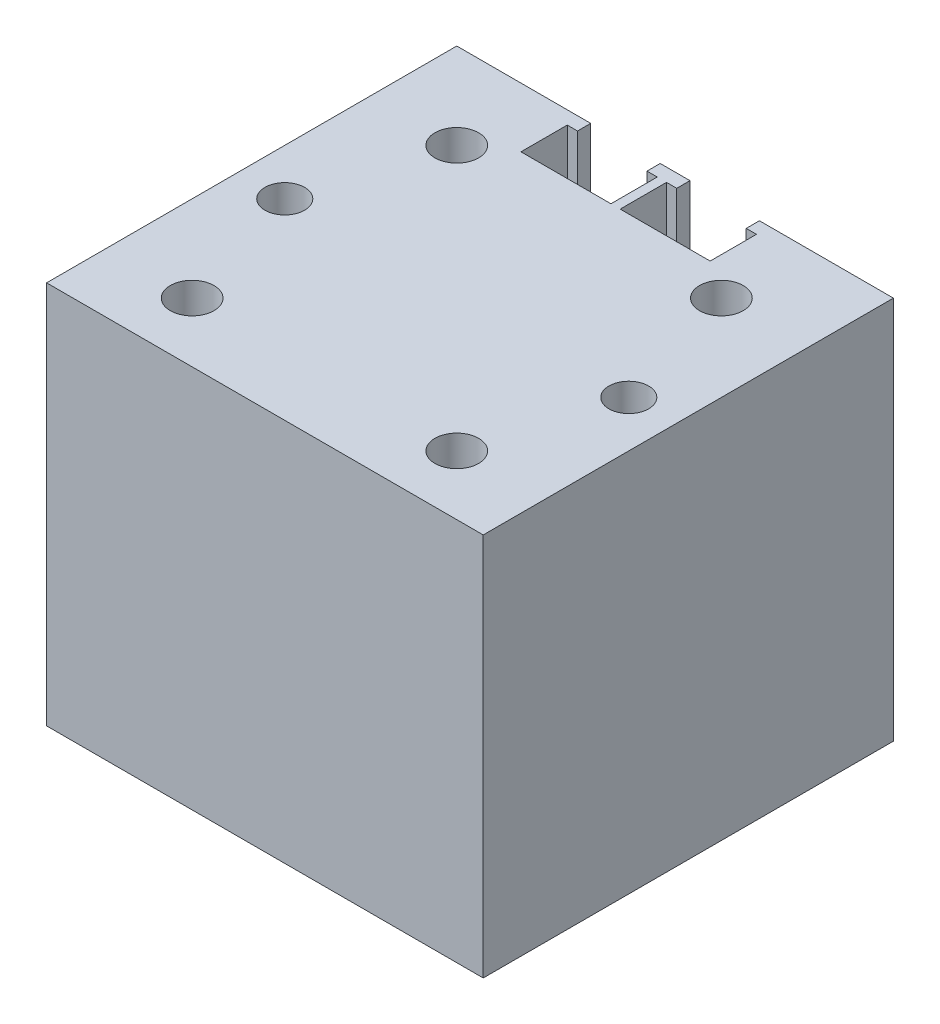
ISO-10303-21;
HEADER;
FILE_DESCRIPTION(('STEP AP214'),'2;1');
FILE_NAME('part.step','',(''),(''),'','','');
FILE_SCHEMA(('AUTOMOTIVE_DESIGN { 1 0 10303 214 1 1 1 1 }'));
ENDSEC;
DATA;
#1=APPLICATION_CONTEXT('core data for automotive mechanical design processes');
#2=APPLICATION_PROTOCOL_DEFINITION('international standard','automotive_design',2000,#1);
#3=PRODUCT_CONTEXT('',#1,'mechanical');
#4=PRODUCT('Part','Part','',(#3));
#5=PRODUCT_RELATED_PRODUCT_CATEGORY('part','',(#4));
#6=PRODUCT_DEFINITION_FORMATION('','',#4);
#7=PRODUCT_DEFINITION_CONTEXT('part definition',#1,'design');
#8=PRODUCT_DEFINITION('design','',#6,#7);
#9=PRODUCT_DEFINITION_SHAPE('','',#8);
#10=(LENGTH_UNIT() NAMED_UNIT(*) SI_UNIT(.MILLI.,.METRE.));
#11=(NAMED_UNIT(*) PLANE_ANGLE_UNIT() SI_UNIT($,.RADIAN.));
#12=(NAMED_UNIT(*) SI_UNIT($,.STERADIAN.) SOLID_ANGLE_UNIT());
#13=UNCERTAINTY_MEASURE_WITH_UNIT(LENGTH_MEASURE(1.E-05),#10,'distance_accuracy_value','');
#14=(GEOMETRIC_REPRESENTATION_CONTEXT(3) GLOBAL_UNCERTAINTY_ASSIGNED_CONTEXT((#13)) GLOBAL_UNIT_ASSIGNED_CONTEXT((#10,
#11,#12)) REPRESENTATION_CONTEXT('',''));
#15=CARTESIAN_POINT('',(0.,0.,0.));
#16=DIRECTION('',(0.,0.,1.));
#17=DIRECTION('',(1.,0.,0.));
#18=AXIS2_PLACEMENT_3D('',#15,#16,#17);
#19=CARTESIAN_POINT('',(-16.5,29.,0.));
#20=DIRECTION('',(1.,0.,0.));
#21=DIRECTION('',(0.,0.,-1.));
#22=AXIS2_PLACEMENT_3D('',#19,#20,#21);
#23=PLANE('',#22);
#24=CARTESIAN_POINT('',(-16.5,22.,-19.5000000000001));
#25=DIRECTION('',(-1.,0.,0.));
#26=DIRECTION('',(0.,0.,1.));
#27=AXIS2_PLACEMENT_3D('',#24,#25,#26);
#28=CIRCLE('',#27,2.065);
#29=CARTESIAN_POINT('',(-16.5,22.,-17.435));
#30=VERTEX_POINT('',#29);
#31=EDGE_CURVE('E857',#30,#30,#28,.T.);
#32=ORIENTED_EDGE('',*,*,#31,.F.);
#33=EDGE_LOOP('',(#32));
#34=FACE_BOUND('',#33,.T.);
#35=CARTESIAN_POINT('',(-16.5,5.99999999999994,-9.50000000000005));
#36=DIRECTION('',(-1.,0.,0.));
#37=DIRECTION('',(0.,0.,1.));
#38=AXIS2_PLACEMENT_3D('',#35,#36,#37);
#39=CIRCLE('',#38,2.065);
#40=CARTESIAN_POINT('',(-16.5,5.99999999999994,-7.43500000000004));
#41=VERTEX_POINT('',#40);
#42=EDGE_CURVE('E860',#41,#41,#39,.T.);
#43=ORIENTED_EDGE('',*,*,#42,.F.);
#44=EDGE_LOOP('',(#43));
#45=FACE_BOUND('',#44,.T.);
#46=DIRECTION('',(0.,0.,1.));
#47=VECTOR('',#46,1.);
#48=CARTESIAN_POINT('',(-16.5,0.,0.));
#49=LINE('',#48,#47);
#50=CARTESIAN_POINT('',(-16.5,0.,-31.0000000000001));
#51=VERTEX_POINT('',#50);
#52=CARTESIAN_POINT('',(-16.5,0.,0.));
#53=VERTEX_POINT('',#52);
#54=EDGE_CURVE('E612',#51,#53,#49,.T.);
#55=ORIENTED_EDGE('',*,*,#54,.T.);
#56=DIRECTION('',(0.,-1.,0.));
#57=VECTOR('',#56,1.);
#58=CARTESIAN_POINT('',(-16.5,29.,0.));
#59=LINE('',#58,#57);
#60=CARTESIAN_POINT('',(-16.5,29.,0.));
#61=VERTEX_POINT('',#60);
#62=EDGE_CURVE('E11',#61,#53,#59,.T.);
#63=ORIENTED_EDGE('',*,*,#62,.F.);
#64=DIRECTION('',(0.,0.,1.));
#65=VECTOR('',#64,1.);
#66=CARTESIAN_POINT('',(-16.5,29.,0.));
#67=LINE('',#66,#65);
#68=CARTESIAN_POINT('',(-16.5,29.,-31.0000000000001));
#69=VERTEX_POINT('',#68);
#70=EDGE_CURVE('E653',#69,#61,#67,.T.);
#71=ORIENTED_EDGE('',*,*,#70,.F.);
#72=DIRECTION('',(0.,-1.,0.));
#73=VECTOR('',#72,1.);
#74=CARTESIAN_POINT('',(-16.5,29.,-31.0000000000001));
#75=LINE('',#74,#73);
#76=EDGE_CURVE('E691',#69,#51,#75,.T.);
#77=ORIENTED_EDGE('',*,*,#76,.T.);
#78=EDGE_LOOP('',(#55,#63,#71,#77));
#79=FACE_BOUND('',#78,.T.);
#80=ADVANCED_FACE('F350',(#34,#45,#79),#23,.F.);
#81=CARTESIAN_POINT('',(-16.5,29.,0.));
#82=DIRECTION('',(0.,0.,-1.));
#83=DIRECTION('',(-1.,0.,0.));
#84=AXIS2_PLACEMENT_3D('',#81,#82,#83);
#85=PLANE('',#84);
#86=DIRECTION('',(1.,0.,0.));
#87=VECTOR('',#86,1.);
#88=CARTESIAN_POINT('',(-16.5,0.,0.));
#89=LINE('',#88,#87);
#90=CARTESIAN_POINT('',(16.5000000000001,0.,0.));
#91=VERTEX_POINT('',#90);
#92=EDGE_CURVE('E615',#53,#91,#89,.T.);
#93=ORIENTED_EDGE('',*,*,#92,.T.);
#94=DIRECTION('',(0.,-1.,0.));
#95=VECTOR('',#94,1.);
#96=CARTESIAN_POINT('',(16.5000000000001,29.,0.));
#97=LINE('',#96,#95);
#98=CARTESIAN_POINT('',(16.5000000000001,29.,0.));
#99=VERTEX_POINT('',#98);
#100=EDGE_CURVE('E357',#99,#91,#97,.T.);
#101=ORIENTED_EDGE('',*,*,#100,.F.);
#102=DIRECTION('',(1.,0.,0.));
#103=VECTOR('',#102,1.);
#104=CARTESIAN_POINT('',(-16.5,29.,0.));
#105=LINE('',#104,#103);
#106=EDGE_CURVE('E655',#61,#99,#105,.T.);
#107=ORIENTED_EDGE('',*,*,#106,.F.);
#108=ORIENTED_EDGE('',*,*,#62,.T.);
#109=EDGE_LOOP('',(#93,#101,#107,#108));
#110=FACE_BOUND('',#109,.T.);
#111=ADVANCED_FACE('F771',(#110),#85,.F.);
#112=CARTESIAN_POINT('',(16.5000000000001,29.,0.));
#113=DIRECTION('',(-1.,0.,0.));
#114=DIRECTION('',(0.,0.,1.));
#115=AXIS2_PLACEMENT_3D('',#112,#113,#114);
#116=PLANE('',#115);
#117=DIRECTION('',(0.,0.,-1.));
#118=VECTOR('',#117,1.);
#119=CARTESIAN_POINT('',(16.5000000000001,0.,0.));
#120=LINE('',#119,#118);
#121=CARTESIAN_POINT('',(16.5000000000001,0.,-31.0000000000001));
#122=VERTEX_POINT('',#121);
#123=EDGE_CURVE('E617',#91,#122,#120,.T.);
#124=ORIENTED_EDGE('',*,*,#123,.T.);
#125=DIRECTION('',(0.,-1.,0.));
#126=VECTOR('',#125,1.);
#127=CARTESIAN_POINT('',(16.5000000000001,29.,-31.0000000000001));
#128=LINE('',#127,#126);
#129=CARTESIAN_POINT('',(16.5000000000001,29.,-31.0000000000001));
#130=VERTEX_POINT('',#129);
#131=EDGE_CURVE('E742',#130,#122,#128,.T.);
#132=ORIENTED_EDGE('',*,*,#131,.F.);
#133=DIRECTION('',(0.,0.,-1.));
#134=VECTOR('',#133,1.);
#135=CARTESIAN_POINT('',(16.5000000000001,29.,0.));
#136=LINE('',#135,#134);
#137=EDGE_CURVE('E657',#99,#130,#136,.T.);
#138=ORIENTED_EDGE('',*,*,#137,.F.);
#139=ORIENTED_EDGE('',*,*,#100,.T.);
#140=EDGE_LOOP('',(#124,#132,#138,#139));
#141=FACE_BOUND('',#140,.T.);
#142=ADVANCED_FACE('F749',(#141),#116,.F.);
#143=CARTESIAN_POINT('',(6.37500000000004,29.,-31.0000000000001));
#144=DIRECTION('',(0.,0.,1.));
#145=DIRECTION('',(1.,0.,0.));
#146=AXIS2_PLACEMENT_3D('',#143,#144,#145);
#147=PLANE('',#146);
#148=DIRECTION('',(-1.,0.,0.));
#149=VECTOR('',#148,1.);
#150=CARTESIAN_POINT('',(6.37500000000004,0.,-31.0000000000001));
#151=LINE('',#150,#149);
#152=CARTESIAN_POINT('',(6.37500000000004,0.,-31.0000000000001));
#153=VERTEX_POINT('',#152);
#154=EDGE_CURVE('E619',#122,#153,#151,.T.);
#155=ORIENTED_EDGE('',*,*,#154,.T.);
#156=DIRECTION('',(0.,-1.,0.));
#157=VECTOR('',#156,1.);
#158=CARTESIAN_POINT('',(6.37500000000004,29.,-31.0000000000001));
#159=LINE('',#158,#157);
#160=CARTESIAN_POINT('',(6.37500000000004,29.,-31.0000000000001));
#161=VERTEX_POINT('',#160);
#162=EDGE_CURVE('E739',#161,#153,#159,.T.);
#163=ORIENTED_EDGE('',*,*,#162,.F.);
#164=DIRECTION('',(-1.,0.,0.));
#165=VECTOR('',#164,1.);
#166=CARTESIAN_POINT('',(6.37500000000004,29.,-31.0000000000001));
#167=LINE('',#166,#165);
#168=EDGE_CURVE('E659',#130,#161,#167,.T.);
#169=ORIENTED_EDGE('',*,*,#168,.F.);
#170=ORIENTED_EDGE('',*,*,#131,.T.);
#171=EDGE_LOOP('',(#155,#163,#169,#170));
#172=FACE_BOUND('',#171,.T.);
#173=ADVANCED_FACE('F760',(#172),#147,.F.);
#174=CARTESIAN_POINT('',(6.37500000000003,29.,-30.0000000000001));
#175=DIRECTION('',(1.,0.,0.));
#176=DIRECTION('',(0.,0.,-1.));
#177=AXIS2_PLACEMENT_3D('',#174,#175,#176);
#178=PLANE('',#177);
#179=DIRECTION('',(0.,0.,1.));
#180=VECTOR('',#179,1.);
#181=CARTESIAN_POINT('',(6.37500000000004,0.,-30.0000000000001));
#182=LINE('',#181,#180);
#183=CARTESIAN_POINT('',(6.37500000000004,0.,-30.0000000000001));
#184=VERTEX_POINT('',#183);
#185=EDGE_CURVE('E621',#153,#184,#182,.T.);
#186=ORIENTED_EDGE('',*,*,#185,.T.);
#187=DIRECTION('',(0.,-1.,0.));
#188=VECTOR('',#187,1.);
#189=CARTESIAN_POINT('',(6.37500000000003,29.,-30.0000000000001));
#190=LINE('',#189,#188);
#191=CARTESIAN_POINT('',(6.37500000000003,29.,-30.0000000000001));
#192=VERTEX_POINT('',#191);
#193=EDGE_CURVE('E736',#192,#184,#190,.T.);
#194=ORIENTED_EDGE('',*,*,#193,.F.);
#195=DIRECTION('',(0.,0.,1.));
#196=VECTOR('',#195,1.);
#197=CARTESIAN_POINT('',(6.37500000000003,29.,-30.0000000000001));
#198=LINE('',#197,#196);
#199=EDGE_CURVE('E661',#161,#192,#198,.T.);
#200=ORIENTED_EDGE('',*,*,#199,.F.);
#201=ORIENTED_EDGE('',*,*,#162,.T.);
#202=EDGE_LOOP('',(#186,#194,#200,#201));
#203=FACE_BOUND('',#202,.T.);
#204=ADVANCED_FACE('F764',(#203),#178,.F.);
#205=CARTESIAN_POINT('',(7.15000000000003,28.9999999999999,-30.0000000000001));
#206=DIRECTION('',(0.,0.,-1.));
#207=DIRECTION('',(-1.,0.,0.));
#208=AXIS2_PLACEMENT_3D('',#205,#206,#207);
#209=PLANE('',#208);
#210=DIRECTION('',(1.,0.,0.));
#211=VECTOR('',#210,1.);
#212=CARTESIAN_POINT('',(7.15000000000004,0.,-30.0000000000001));
#213=LINE('',#212,#211);
#214=CARTESIAN_POINT('',(7.15000000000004,0.,-30.0000000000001));
#215=VERTEX_POINT('',#214);
#216=EDGE_CURVE('E623',#184,#215,#213,.T.);
#217=ORIENTED_EDGE('',*,*,#216,.T.);
#218=DIRECTION('',(0.,-1.,0.));
#219=VECTOR('',#218,1.);
#220=CARTESIAN_POINT('',(7.15000000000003,28.9999999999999,-30.0000000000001));
#221=LINE('',#220,#219);
#222=CARTESIAN_POINT('',(7.15000000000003,28.9999999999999,-30.0000000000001));
#223=VERTEX_POINT('',#222);
#224=EDGE_CURVE('E733',#223,#215,#221,.T.);
#225=ORIENTED_EDGE('',*,*,#224,.F.);
#226=DIRECTION('',(1.,0.,0.));
#227=VECTOR('',#226,1.);
#228=CARTESIAN_POINT('',(7.15000000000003,28.9999999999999,-30.0000000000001));
#229=LINE('',#228,#227);
#230=EDGE_CURVE('E663',#192,#223,#229,.T.);
#231=ORIENTED_EDGE('',*,*,#230,.F.);
#232=ORIENTED_EDGE('',*,*,#193,.T.);
#233=EDGE_LOOP('',(#217,#225,#231,#232));
#234=FACE_BOUND('',#233,.T.);
#235=ADVANCED_FACE('F840',(#234),#209,.F.);
#236=CARTESIAN_POINT('',(7.15000000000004,29.,-26.5000000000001));
#237=DIRECTION('',(1.,0.,0.));
#238=DIRECTION('',(0.,0.,-1.));
#239=AXIS2_PLACEMENT_3D('',#236,#237,#238);
#240=PLANE('',#239);
#241=DIRECTION('',(0.,0.,1.));
#242=VECTOR('',#241,1.);
#243=CARTESIAN_POINT('',(7.15000000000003,0.,-26.5000000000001));
#244=LINE('',#243,#242);
#245=CARTESIAN_POINT('',(7.15000000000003,0.,-26.5000000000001));
#246=VERTEX_POINT('',#245);
#247=EDGE_CURVE('E625',#215,#246,#244,.T.);
#248=ORIENTED_EDGE('',*,*,#247,.T.);
#249=DIRECTION('',(0.,-1.,0.));
#250=VECTOR('',#249,1.);
#251=CARTESIAN_POINT('',(7.15000000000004,29.,-26.5000000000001));
#252=LINE('',#251,#250);
#253=CARTESIAN_POINT('',(7.15000000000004,29.,-26.5000000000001));
#254=VERTEX_POINT('',#253);
#255=EDGE_CURVE('E730',#254,#246,#252,.T.);
#256=ORIENTED_EDGE('',*,*,#255,.F.);
#257=DIRECTION('',(0.,0.,1.));
#258=VECTOR('',#257,1.);
#259=CARTESIAN_POINT('',(7.15000000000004,29.,-26.5000000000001));
#260=LINE('',#259,#258);
#261=EDGE_CURVE('E665',#223,#254,#260,.T.);
#262=ORIENTED_EDGE('',*,*,#261,.F.);
#263=ORIENTED_EDGE('',*,*,#224,.T.);
#264=EDGE_LOOP('',(#248,#256,#262,#263));
#265=FACE_BOUND('',#264,.T.);
#266=ADVANCED_FACE('F838',(#265),#240,.F.);
#267=CARTESIAN_POINT('',(0.349999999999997,29.,-26.5000000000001));
#268=DIRECTION('',(0.,0.,1.));
#269=DIRECTION('',(1.,0.,0.));
#270=AXIS2_PLACEMENT_3D('',#267,#268,#269);
#271=PLANE('',#270);
#272=DIRECTION('',(-1.,0.,0.));
#273=VECTOR('',#272,1.);
#274=CARTESIAN_POINT('',(0.349999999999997,0.,-26.5000000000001));
#275=LINE('',#274,#273);
#276=CARTESIAN_POINT('',(0.349999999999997,0.,-26.5000000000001));
#277=VERTEX_POINT('',#276);
#278=EDGE_CURVE('E627',#246,#277,#275,.T.);
#279=ORIENTED_EDGE('',*,*,#278,.T.);
#280=DIRECTION('',(0.,-1.,0.));
#281=VECTOR('',#280,1.);
#282=CARTESIAN_POINT('',(0.349999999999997,29.,-26.5000000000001));
#283=LINE('',#282,#281);
#284=CARTESIAN_POINT('',(0.349999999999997,29.,-26.5000000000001));
#285=VERTEX_POINT('',#284);
#286=EDGE_CURVE('E727',#285,#277,#283,.T.);
#287=ORIENTED_EDGE('',*,*,#286,.F.);
#288=DIRECTION('',(-1.,0.,0.));
#289=VECTOR('',#288,1.);
#290=CARTESIAN_POINT('',(0.349999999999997,29.,-26.5000000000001));
#291=LINE('',#290,#289);
#292=EDGE_CURVE('E667',#254,#285,#291,.T.);
#293=ORIENTED_EDGE('',*,*,#292,.F.);
#294=ORIENTED_EDGE('',*,*,#255,.T.);
#295=EDGE_LOOP('',(#279,#287,#293,#294));
#296=FACE_BOUND('',#295,.T.);
#297=ADVANCED_FACE('F833',(#296),#271,.F.);
#298=CARTESIAN_POINT('',(0.349999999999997,29.,-30.0000000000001));
#299=DIRECTION('',(-1.,0.,0.));
#300=DIRECTION('',(0.,0.,1.));
#301=AXIS2_PLACEMENT_3D('',#298,#299,#300);
#302=PLANE('',#301);
#303=DIRECTION('',(0.,0.,-1.));
#304=VECTOR('',#303,1.);
#305=CARTESIAN_POINT('',(0.349999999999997,0.,-30.0000000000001));
#306=LINE('',#305,#304);
#307=CARTESIAN_POINT('',(0.349999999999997,0.,-30.0000000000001));
#308=VERTEX_POINT('',#307);
#309=EDGE_CURVE('E629',#277,#308,#306,.T.);
#310=ORIENTED_EDGE('',*,*,#309,.T.);
#311=DIRECTION('',(0.,-1.,0.));
#312=VECTOR('',#311,1.);
#313=CARTESIAN_POINT('',(0.349999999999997,29.,-30.0000000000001));
#314=LINE('',#313,#312);
#315=CARTESIAN_POINT('',(0.349999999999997,29.,-30.0000000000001));
#316=VERTEX_POINT('',#315);
#317=EDGE_CURVE('E724',#316,#308,#314,.T.);
#318=ORIENTED_EDGE('',*,*,#317,.F.);
#319=DIRECTION('',(0.,0.,-1.));
#320=VECTOR('',#319,1.);
#321=CARTESIAN_POINT('',(0.349999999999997,29.,-30.0000000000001));
#322=LINE('',#321,#320);
#323=EDGE_CURVE('E669',#285,#316,#322,.T.);
#324=ORIENTED_EDGE('',*,*,#323,.F.);
#325=ORIENTED_EDGE('',*,*,#286,.T.);
#326=EDGE_LOOP('',(#310,#318,#324,#325));
#327=FACE_BOUND('',#326,.T.);
#328=ADVANCED_FACE('F828',(#327),#302,.F.);
#329=CARTESIAN_POINT('',(1.12499999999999,29.,-30.0000000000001));
#330=DIRECTION('',(0.,0.,-1.));
#331=DIRECTION('',(-1.,0.,0.));
#332=AXIS2_PLACEMENT_3D('',#329,#330,#331);
#333=PLANE('',#332);
#334=DIRECTION('',(1.,0.,0.));
#335=VECTOR('',#334,1.);
#336=CARTESIAN_POINT('',(1.12499999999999,0.,-30.0000000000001));
#337=LINE('',#336,#335);
#338=CARTESIAN_POINT('',(1.12499999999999,0.,-30.0000000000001));
#339=VERTEX_POINT('',#338);
#340=EDGE_CURVE('E631',#308,#339,#337,.T.);
#341=ORIENTED_EDGE('',*,*,#340,.T.);
#342=DIRECTION('',(0.,-1.,0.));
#343=VECTOR('',#342,1.);
#344=CARTESIAN_POINT('',(1.12499999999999,29.,-30.0000000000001));
#345=LINE('',#344,#343);
#346=CARTESIAN_POINT('',(1.12499999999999,29.,-30.0000000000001));
#347=VERTEX_POINT('',#346);
#348=EDGE_CURVE('E721',#347,#339,#345,.T.);
#349=ORIENTED_EDGE('',*,*,#348,.F.);
#350=DIRECTION('',(1.,0.,0.));
#351=VECTOR('',#350,1.);
#352=CARTESIAN_POINT('',(1.12499999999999,29.,-30.0000000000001));
#353=LINE('',#352,#351);
#354=EDGE_CURVE('E671',#316,#347,#353,.T.);
#355=ORIENTED_EDGE('',*,*,#354,.F.);
#356=ORIENTED_EDGE('',*,*,#317,.T.);
#357=EDGE_LOOP('',(#341,#349,#355,#356));
#358=FACE_BOUND('',#357,.T.);
#359=ADVANCED_FACE('F824',(#358),#333,.F.);
#360=CARTESIAN_POINT('',(1.125,29.,-31.0000000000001));
#361=DIRECTION('',(-1.,0.,0.));
#362=DIRECTION('',(0.,0.,1.));
#363=AXIS2_PLACEMENT_3D('',#360,#361,#362);
#364=PLANE('',#363);
#365=DIRECTION('',(0.,0.,-1.));
#366=VECTOR('',#365,1.);
#367=CARTESIAN_POINT('',(1.125,0.,-31.0000000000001));
#368=LINE('',#367,#366);
#369=CARTESIAN_POINT('',(1.125,0.,-31.0000000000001));
#370=VERTEX_POINT('',#369);
#371=EDGE_CURVE('E633',#339,#370,#368,.T.);
#372=ORIENTED_EDGE('',*,*,#371,.T.);
#373=DIRECTION('',(0.,-1.,0.));
#374=VECTOR('',#373,1.);
#375=CARTESIAN_POINT('',(1.125,29.,-31.0000000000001));
#376=LINE('',#375,#374);
#377=CARTESIAN_POINT('',(1.125,29.,-31.0000000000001));
#378=VERTEX_POINT('',#377);
#379=EDGE_CURVE('E718',#378,#370,#376,.T.);
#380=ORIENTED_EDGE('',*,*,#379,.F.);
#381=DIRECTION('',(0.,0.,-1.));
#382=VECTOR('',#381,1.);
#383=CARTESIAN_POINT('',(1.125,29.,-31.0000000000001));
#384=LINE('',#383,#382);
#385=EDGE_CURVE('E673',#347,#378,#384,.T.);
#386=ORIENTED_EDGE('',*,*,#385,.F.);
#387=ORIENTED_EDGE('',*,*,#348,.T.);
#388=EDGE_LOOP('',(#372,#380,#386,#387));
#389=FACE_BOUND('',#388,.T.);
#390=ADVANCED_FACE('F819',(#389),#364,.F.);
#391=CARTESIAN_POINT('',(-1.125,29.,-31.0000000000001));
#392=DIRECTION('',(0.,0.,1.));
#393=DIRECTION('',(1.,0.,0.));
#394=AXIS2_PLACEMENT_3D('',#391,#392,#393);
#395=PLANE('',#394);
#396=DIRECTION('',(-1.,0.,0.));
#397=VECTOR('',#396,1.);
#398=CARTESIAN_POINT('',(-1.125,0.,-31.0000000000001));
#399=LINE('',#398,#397);
#400=CARTESIAN_POINT('',(-1.125,0.,-31.0000000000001));
#401=VERTEX_POINT('',#400);
#402=EDGE_CURVE('E635',#370,#401,#399,.T.);
#403=ORIENTED_EDGE('',*,*,#402,.T.);
#404=DIRECTION('',(0.,-1.,0.));
#405=VECTOR('',#404,1.);
#406=CARTESIAN_POINT('',(-1.125,29.,-31.0000000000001));
#407=LINE('',#406,#405);
#408=CARTESIAN_POINT('',(-1.125,29.,-31.0000000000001));
#409=VERTEX_POINT('',#408);
#410=EDGE_CURVE('E715',#409,#401,#407,.T.);
#411=ORIENTED_EDGE('',*,*,#410,.F.);
#412=DIRECTION('',(-1.,0.,0.));
#413=VECTOR('',#412,1.);
#414=CARTESIAN_POINT('',(-1.125,29.,-31.0000000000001));
#415=LINE('',#414,#413);
#416=EDGE_CURVE('E675',#378,#409,#415,.T.);
#417=ORIENTED_EDGE('',*,*,#416,.F.);
#418=ORIENTED_EDGE('',*,*,#379,.T.);
#419=EDGE_LOOP('',(#403,#411,#417,#418));
#420=FACE_BOUND('',#419,.T.);
#421=ADVANCED_FACE('F813',(#420),#395,.F.);
#422=CARTESIAN_POINT('',(-1.125,29.,-31.0000000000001));
#423=DIRECTION('',(1.,0.,0.));
#424=DIRECTION('',(0.,0.,-1.));
#425=AXIS2_PLACEMENT_3D('',#422,#423,#424);
#426=PLANE('',#425);
#427=DIRECTION('',(0.,0.,1.));
#428=VECTOR('',#427,1.);
#429=CARTESIAN_POINT('',(-1.125,0.,-31.0000000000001));
#430=LINE('',#429,#428);
#431=CARTESIAN_POINT('',(-1.12500000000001,0.,-30.0000000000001));
#432=VERTEX_POINT('',#431);
#433=EDGE_CURVE('E637',#401,#432,#430,.T.);
#434=ORIENTED_EDGE('',*,*,#433,.T.);
#435=DIRECTION('',(0.,-1.,0.));
#436=VECTOR('',#435,1.);
#437=CARTESIAN_POINT('',(-1.12500000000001,29.,-30.0000000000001));
#438=LINE('',#437,#436);
#439=CARTESIAN_POINT('',(-1.12500000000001,29.,-30.0000000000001));
#440=VERTEX_POINT('',#439);
#441=EDGE_CURVE('E712',#440,#432,#438,.T.);
#442=ORIENTED_EDGE('',*,*,#441,.F.);
#443=DIRECTION('',(0.,0.,1.));
#444=VECTOR('',#443,1.);
#445=CARTESIAN_POINT('',(-1.125,29.,-31.0000000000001));
#446=LINE('',#445,#444);
#447=EDGE_CURVE('E677',#409,#440,#446,.T.);
#448=ORIENTED_EDGE('',*,*,#447,.F.);
#449=ORIENTED_EDGE('',*,*,#410,.T.);
#450=EDGE_LOOP('',(#434,#442,#448,#449));
#451=FACE_BOUND('',#450,.T.);
#452=ADVANCED_FACE('F809',(#451),#426,.F.);
#453=CARTESIAN_POINT('',(-1.12500000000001,29.,-30.0000000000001));
#454=DIRECTION('',(0.,0.,-1.));
#455=DIRECTION('',(-1.,0.,0.));
#456=AXIS2_PLACEMENT_3D('',#453,#454,#455);
#457=PLANE('',#456);
#458=DIRECTION('',(1.,0.,0.));
#459=VECTOR('',#458,1.);
#460=CARTESIAN_POINT('',(-1.12500000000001,0.,-30.0000000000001));
#461=LINE('',#460,#459);
#462=CARTESIAN_POINT('',(-0.350000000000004,0.,-30.0000000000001));
#463=VERTEX_POINT('',#462);
#464=EDGE_CURVE('E639',#432,#463,#461,.T.);
#465=ORIENTED_EDGE('',*,*,#464,.T.);
#466=DIRECTION('',(0.,-1.,0.));
#467=VECTOR('',#466,1.);
#468=CARTESIAN_POINT('',(-0.350000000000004,29.,-30.0000000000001));
#469=LINE('',#468,#467);
#470=CARTESIAN_POINT('',(-0.350000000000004,29.,-30.0000000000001));
#471=VERTEX_POINT('',#470);
#472=EDGE_CURVE('E709',#471,#463,#469,.T.);
#473=ORIENTED_EDGE('',*,*,#472,.F.);
#474=DIRECTION('',(1.,0.,0.));
#475=VECTOR('',#474,1.);
#476=CARTESIAN_POINT('',(-1.12500000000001,29.,-30.0000000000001));
#477=LINE('',#476,#475);
#478=EDGE_CURVE('E679',#440,#471,#477,.T.);
#479=ORIENTED_EDGE('',*,*,#478,.F.);
#480=ORIENTED_EDGE('',*,*,#441,.T.);
#481=EDGE_LOOP('',(#465,#473,#479,#480));
#482=FACE_BOUND('',#481,.T.);
#483=ADVANCED_FACE('F804',(#482),#457,.F.);
#484=CARTESIAN_POINT('',(-0.350000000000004,29.,-30.0000000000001));
#485=DIRECTION('',(1.,0.,0.));
#486=DIRECTION('',(0.,0.,-1.));
#487=AXIS2_PLACEMENT_3D('',#484,#485,#486);
#488=PLANE('',#487);
#489=DIRECTION('',(0.,0.,1.));
#490=VECTOR('',#489,1.);
#491=CARTESIAN_POINT('',(-0.350000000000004,0.,-30.0000000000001));
#492=LINE('',#491,#490);
#493=CARTESIAN_POINT('',(-0.350000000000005,0.,-26.5000000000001));
#494=VERTEX_POINT('',#493);
#495=EDGE_CURVE('E641',#463,#494,#492,.T.);
#496=ORIENTED_EDGE('',*,*,#495,.T.);
#497=DIRECTION('',(0.,-1.,0.));
#498=VECTOR('',#497,1.);
#499=CARTESIAN_POINT('',(-0.350000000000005,29.,-26.5000000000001));
#500=LINE('',#499,#498);
#501=CARTESIAN_POINT('',(-0.350000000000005,29.,-26.5000000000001));
#502=VERTEX_POINT('',#501);
#503=EDGE_CURVE('E706',#502,#494,#500,.T.);
#504=ORIENTED_EDGE('',*,*,#503,.F.);
#505=DIRECTION('',(0.,0.,1.));
#506=VECTOR('',#505,1.);
#507=CARTESIAN_POINT('',(-0.350000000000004,29.,-30.0000000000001));
#508=LINE('',#507,#506);
#509=EDGE_CURVE('E681',#471,#502,#508,.T.);
#510=ORIENTED_EDGE('',*,*,#509,.F.);
#511=ORIENTED_EDGE('',*,*,#472,.T.);
#512=EDGE_LOOP('',(#496,#504,#510,#511));
#513=FACE_BOUND('',#512,.T.);
#514=ADVANCED_FACE('F798',(#513),#488,.F.);
#515=CARTESIAN_POINT('',(-0.350000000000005,29.,-26.5000000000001));
#516=DIRECTION('',(0.,0.,1.));
#517=DIRECTION('',(1.,0.,0.));
#518=AXIS2_PLACEMENT_3D('',#515,#516,#517);
#519=PLANE('',#518);
#520=DIRECTION('',(-1.,0.,0.));
#521=VECTOR('',#520,1.);
#522=CARTESIAN_POINT('',(-0.350000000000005,0.,-26.5000000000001));
#523=LINE('',#522,#521);
#524=CARTESIAN_POINT('',(-7.15000000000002,0.,-26.5000000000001));
#525=VERTEX_POINT('',#524);
#526=EDGE_CURVE('E643',#494,#525,#523,.T.);
#527=ORIENTED_EDGE('',*,*,#526,.T.);
#528=DIRECTION('',(0.,-1.,0.));
#529=VECTOR('',#528,1.);
#530=CARTESIAN_POINT('',(-7.15000000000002,29.,-26.5000000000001));
#531=LINE('',#530,#529);
#532=CARTESIAN_POINT('',(-7.15000000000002,29.,-26.5000000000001));
#533=VERTEX_POINT('',#532);
#534=EDGE_CURVE('E703',#533,#525,#531,.T.);
#535=ORIENTED_EDGE('',*,*,#534,.F.);
#536=DIRECTION('',(-1.,0.,0.));
#537=VECTOR('',#536,1.);
#538=CARTESIAN_POINT('',(-0.350000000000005,29.,-26.5000000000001));
#539=LINE('',#538,#537);
#540=EDGE_CURVE('E683',#502,#533,#539,.T.);
#541=ORIENTED_EDGE('',*,*,#540,.F.);
#542=ORIENTED_EDGE('',*,*,#503,.T.);
#543=EDGE_LOOP('',(#527,#535,#541,#542));
#544=FACE_BOUND('',#543,.T.);
#545=ADVANCED_FACE('F794',(#544),#519,.F.);
#546=CARTESIAN_POINT('',(-7.15000000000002,29.,-26.5000000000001));
#547=DIRECTION('',(-1.,0.,0.));
#548=DIRECTION('',(0.,0.,1.));
#549=AXIS2_PLACEMENT_3D('',#546,#547,#548);
#550=PLANE('',#549);
#551=DIRECTION('',(0.,0.,-1.));
#552=VECTOR('',#551,1.);
#553=CARTESIAN_POINT('',(-7.15000000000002,0.,-26.5000000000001));
#554=LINE('',#553,#552);
#555=CARTESIAN_POINT('',(-7.15000000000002,0.,-30.0000000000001));
#556=VERTEX_POINT('',#555);
#557=EDGE_CURVE('E645',#525,#556,#554,.T.);
#558=ORIENTED_EDGE('',*,*,#557,.T.);
#559=DIRECTION('',(0.,-1.,0.));
#560=VECTOR('',#559,1.);
#561=CARTESIAN_POINT('',(-7.15000000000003,29.,-30.0000000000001));
#562=LINE('',#561,#560);
#563=CARTESIAN_POINT('',(-7.15000000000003,29.,-30.0000000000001));
#564=VERTEX_POINT('',#563);
#565=EDGE_CURVE('E700',#564,#556,#562,.T.);
#566=ORIENTED_EDGE('',*,*,#565,.F.);
#567=DIRECTION('',(0.,0.,-1.));
#568=VECTOR('',#567,1.);
#569=CARTESIAN_POINT('',(-7.15000000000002,29.,-26.5000000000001));
#570=LINE('',#569,#568);
#571=EDGE_CURVE('E685',#533,#564,#570,.T.);
#572=ORIENTED_EDGE('',*,*,#571,.F.);
#573=ORIENTED_EDGE('',*,*,#534,.T.);
#574=EDGE_LOOP('',(#558,#566,#572,#573));
#575=FACE_BOUND('',#574,.T.);
#576=ADVANCED_FACE('F789',(#575),#550,.F.);
#577=CARTESIAN_POINT('',(-7.15000000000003,29.,-30.0000000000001));
#578=DIRECTION('',(0.,0.,-1.));
#579=DIRECTION('',(-1.,0.,0.));
#580=AXIS2_PLACEMENT_3D('',#577,#578,#579);
#581=PLANE('',#580);
#582=DIRECTION('',(1.,0.,0.));
#583=VECTOR('',#582,1.);
#584=CARTESIAN_POINT('',(-7.15000000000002,0.,-30.0000000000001));
#585=LINE('',#584,#583);
#586=CARTESIAN_POINT('',(-6.37500000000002,0.,-30.0000000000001));
#587=VERTEX_POINT('',#586);
#588=EDGE_CURVE('E647',#556,#587,#585,.T.);
#589=ORIENTED_EDGE('',*,*,#588,.T.);
#590=DIRECTION('',(0.,-1.,0.));
#591=VECTOR('',#590,1.);
#592=CARTESIAN_POINT('',(-6.37500000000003,28.9999999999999,-30.0000000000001));
#593=LINE('',#592,#591);
#594=CARTESIAN_POINT('',(-6.37500000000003,28.9999999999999,-30.0000000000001));
#595=VERTEX_POINT('',#594);
#596=EDGE_CURVE('E697',#595,#587,#593,.T.);
#597=ORIENTED_EDGE('',*,*,#596,.F.);
#598=DIRECTION('',(1.,0.,0.));
#599=VECTOR('',#598,1.);
#600=CARTESIAN_POINT('',(-7.15000000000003,29.,-30.0000000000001));
#601=LINE('',#600,#599);
#602=EDGE_CURVE('E687',#564,#595,#601,.T.);
#603=ORIENTED_EDGE('',*,*,#602,.F.);
#604=ORIENTED_EDGE('',*,*,#565,.T.);
#605=EDGE_LOOP('',(#589,#597,#603,#604));
#606=FACE_BOUND('',#605,.T.);
#607=ADVANCED_FACE('F783',(#606),#581,.F.);
#608=CARTESIAN_POINT('',(-6.37500000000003,28.9999999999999,-30.0000000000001));
#609=DIRECTION('',(-1.,0.,0.));
#610=DIRECTION('',(0.,0.,1.));
#611=AXIS2_PLACEMENT_3D('',#608,#609,#610);
#612=PLANE('',#611);
#613=DIRECTION('',(0.,0.,-1.));
#614=VECTOR('',#613,1.);
#615=CARTESIAN_POINT('',(-6.37500000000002,0.,-30.0000000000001));
#616=LINE('',#615,#614);
#617=CARTESIAN_POINT('',(-6.37500000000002,0.,-31.0000000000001));
#618=VERTEX_POINT('',#617);
#619=EDGE_CURVE('E649',#587,#618,#616,.T.);
#620=ORIENTED_EDGE('',*,*,#619,.T.);
#621=DIRECTION('',(0.,-1.,0.));
#622=VECTOR('',#621,1.);
#623=CARTESIAN_POINT('',(-6.37500000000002,28.9999999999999,-31.0000000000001));
#624=LINE('',#623,#622);
#625=CARTESIAN_POINT('',(-6.37500000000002,28.9999999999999,-31.0000000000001));
#626=VERTEX_POINT('',#625);
#627=EDGE_CURVE('E694',#626,#618,#624,.T.);
#628=ORIENTED_EDGE('',*,*,#627,.F.);
#629=DIRECTION('',(0.,0.,-1.));
#630=VECTOR('',#629,1.);
#631=CARTESIAN_POINT('',(-6.37500000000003,28.9999999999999,-30.0000000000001));
#632=LINE('',#631,#630);
#633=EDGE_CURVE('E369',#595,#626,#632,.T.);
#634=ORIENTED_EDGE('',*,*,#633,.F.);
#635=ORIENTED_EDGE('',*,*,#596,.T.);
#636=EDGE_LOOP('',(#620,#628,#634,#635));
#637=FACE_BOUND('',#636,.T.);
#638=ADVANCED_FACE('F779',(#637),#612,.F.);
#639=CARTESIAN_POINT('',(-16.5,29.,-31.0000000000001));
#640=DIRECTION('',(0.,0.,1.));
#641=DIRECTION('',(1.,0.,0.));
#642=AXIS2_PLACEMENT_3D('',#639,#640,#641);
#643=PLANE('',#642);
#644=DIRECTION('',(-1.,0.,0.));
#645=VECTOR('',#644,1.);
#646=CARTESIAN_POINT('',(-16.5,0.,-31.0000000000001));
#647=LINE('',#646,#645);
#648=EDGE_CURVE('E651',#618,#51,#647,.T.);
#649=ORIENTED_EDGE('',*,*,#648,.T.);
#650=ORIENTED_EDGE('',*,*,#76,.F.);
#651=DIRECTION('',(-1.,0.,0.));
#652=VECTOR('',#651,1.);
#653=CARTESIAN_POINT('',(-16.5,29.,-31.0000000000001));
#654=LINE('',#653,#652);
#655=EDGE_CURVE('E364',#626,#69,#654,.T.);
#656=ORIENTED_EDGE('',*,*,#655,.F.);
#657=ORIENTED_EDGE('',*,*,#627,.T.);
#658=EDGE_LOOP('',(#649,#650,#656,#657));
#659=FACE_BOUND('',#658,.T.);
#660=ADVANCED_FACE('F777',(#659),#643,.F.);
#661=CARTESIAN_POINT('',(-16.5,29.,0.));
#662=DIRECTION('',(0.,-1.,0.));
#663=DIRECTION('',(0.,0.,-1.));
#664=AXIS2_PLACEMENT_3D('',#661,#662,#663);
#665=PLANE('',#664);
#666=CARTESIAN_POINT('',(-13.0000000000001,29.,-14.5000000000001));
#667=DIRECTION('',(0.,1.,0.));
#668=DIRECTION('',(0.,0.,1.));
#669=AXIS2_PLACEMENT_3D('',#666,#667,#668);
#670=CIRCLE('',#669,1.5);
#671=CARTESIAN_POINT('',(-13.0000000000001,29.,-13.0000000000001));
#672=VERTEX_POINT('',#671);
#673=EDGE_CURVE('E555',#672,#672,#670,.T.);
#674=ORIENTED_EDGE('',*,*,#673,.F.);
#675=EDGE_LOOP('',(#674));
#676=FACE_BOUND('',#675,.T.);
#677=CARTESIAN_POINT('',(13.,29.,-14.5000000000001));
#678=DIRECTION('',(0.,1.,0.));
#679=DIRECTION('',(0.,0.,1.));
#680=AXIS2_PLACEMENT_3D('',#677,#678,#679);
#681=CIRCLE('',#680,1.5);
#682=CARTESIAN_POINT('',(13.,29.,-13.0000000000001));
#683=VERTEX_POINT('',#682);
#684=EDGE_CURVE('E561',#683,#683,#681,.T.);
#685=ORIENTED_EDGE('',*,*,#684,.F.);
#686=EDGE_LOOP('',(#685));
#687=FACE_BOUND('',#686,.T.);
#688=CARTESIAN_POINT('',(-10.0000000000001,29.,-24.5000000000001));
#689=DIRECTION('',(0.,1.,0.));
#690=DIRECTION('',(0.,0.,1.));
#691=AXIS2_PLACEMENT_3D('',#688,#689,#690);
#692=CIRCLE('',#691,1.65);
#693=CARTESIAN_POINT('',(-10.0000000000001,29.,-22.8500000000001));
#694=VERTEX_POINT('',#693);
#695=EDGE_CURVE('E570',#694,#694,#692,.T.);
#696=ORIENTED_EDGE('',*,*,#695,.F.);
#697=EDGE_LOOP('',(#696));
#698=FACE_BOUND('',#697,.T.);
#699=CARTESIAN_POINT('',(-10.,29.,-4.50000000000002));
#700=DIRECTION('',(0.,1.,0.));
#701=DIRECTION('',(0.,0.,1.));
#702=AXIS2_PLACEMENT_3D('',#699,#700,#701);
#703=CIRCLE('',#702,1.65);
#704=CARTESIAN_POINT('',(-10.,29.,-2.85000000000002));
#705=VERTEX_POINT('',#704);
#706=EDGE_CURVE('E576',#705,#705,#703,.T.);
#707=ORIENTED_EDGE('',*,*,#706,.F.);
#708=EDGE_LOOP('',(#707));
#709=FACE_BOUND('',#708,.T.);
#710=CARTESIAN_POINT('',(10.,29.,-4.50000000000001));
#711=DIRECTION('',(0.,1.,0.));
#712=DIRECTION('',(0.,0.,1.));
#713=AXIS2_PLACEMENT_3D('',#710,#711,#712);
#714=CIRCLE('',#713,1.65);
#715=CARTESIAN_POINT('',(10.,29.,-2.85));
#716=VERTEX_POINT('',#715);
#717=EDGE_CURVE('E582',#716,#716,#714,.T.);
#718=ORIENTED_EDGE('',*,*,#717,.F.);
#719=EDGE_LOOP('',(#718));
#720=FACE_BOUND('',#719,.T.);
#721=CARTESIAN_POINT('',(10.,29.,-24.5000000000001));
#722=DIRECTION('',(0.,1.,0.));
#723=DIRECTION('',(0.,0.,1.));
#724=AXIS2_PLACEMENT_3D('',#721,#722,#723);
#725=CIRCLE('',#724,1.65);
#726=CARTESIAN_POINT('',(10.,29.,-22.8500000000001));
#727=VERTEX_POINT('',#726);
#728=EDGE_CURVE('E588',#727,#727,#725,.T.);
#729=ORIENTED_EDGE('',*,*,#728,.F.);
#730=EDGE_LOOP('',(#729));
#731=FACE_BOUND('',#730,.T.);
#732=ORIENTED_EDGE('',*,*,#70,.T.);
#733=ORIENTED_EDGE('',*,*,#106,.T.);
#734=ORIENTED_EDGE('',*,*,#137,.T.);
#735=ORIENTED_EDGE('',*,*,#168,.T.);
#736=ORIENTED_EDGE('',*,*,#199,.T.);
#737=ORIENTED_EDGE('',*,*,#230,.T.);
#738=ORIENTED_EDGE('',*,*,#261,.T.);
#739=ORIENTED_EDGE('',*,*,#292,.T.);
#740=ORIENTED_EDGE('',*,*,#323,.T.);
#741=ORIENTED_EDGE('',*,*,#354,.T.);
#742=ORIENTED_EDGE('',*,*,#385,.T.);
#743=ORIENTED_EDGE('',*,*,#416,.T.);
#744=ORIENTED_EDGE('',*,*,#447,.T.);
#745=ORIENTED_EDGE('',*,*,#478,.T.);
#746=ORIENTED_EDGE('',*,*,#509,.T.);
#747=ORIENTED_EDGE('',*,*,#540,.T.);
#748=ORIENTED_EDGE('',*,*,#571,.T.);
#749=ORIENTED_EDGE('',*,*,#602,.T.);
#750=ORIENTED_EDGE('',*,*,#633,.T.);
#751=ORIENTED_EDGE('',*,*,#655,.T.);
#752=EDGE_LOOP('',(#732,#733,#734,#735,#736,#737,#738,#739,#740,#741,#742,#743,#744,#745,#746,
#747,#748,#749,#750,#751));
#753=FACE_BOUND('',#752,.T.);
#754=ADVANCED_FACE('F767',(#676,#687,#698,#709,#720,#731,#753),#665,.F.);
#755=CARTESIAN_POINT('',(-16.5,0.,0.));
#756=DIRECTION('',(0.,-1.,0.));
#757=DIRECTION('',(0.,0.,-1.));
#758=AXIS2_PLACEMENT_3D('',#755,#756,#757);
#759=PLANE('',#758);
#760=CARTESIAN_POINT('',(-13.0000000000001,0.,-20.5000000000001));
#761=DIRECTION('',(0.,-1.,0.));
#762=DIRECTION('',(0.,0.,-1.));
#763=AXIS2_PLACEMENT_3D('',#760,#761,#762);
#764=CIRCLE('',#763,1.5);
#765=CARTESIAN_POINT('',(-13.0000000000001,0.,-22.0000000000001));
#766=VERTEX_POINT('',#765);
#767=EDGE_CURVE('E866',#766,#766,#764,.T.);
#768=ORIENTED_EDGE('',*,*,#767,.F.);
#769=EDGE_LOOP('',(#768));
#770=FACE_BOUND('',#769,.T.);
#771=CARTESIAN_POINT('',(13.,0.,-8.50000000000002));
#772=DIRECTION('',(0.,-1.,0.));
#773=DIRECTION('',(0.,0.,-1.));
#774=AXIS2_PLACEMENT_3D('',#771,#772,#773);
#775=CIRCLE('',#774,1.5);
#776=CARTESIAN_POINT('',(13.,0.,-10.));
#777=VERTEX_POINT('',#776);
#778=EDGE_CURVE('E528',#777,#777,#775,.T.);
#779=ORIENTED_EDGE('',*,*,#778,.F.);
#780=EDGE_LOOP('',(#779));
#781=FACE_BOUND('',#780,.T.);
#782=CARTESIAN_POINT('',(10.,0.,-3.50000000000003));
#783=DIRECTION('',(0.,-1.,0.));
#784=DIRECTION('',(0.,0.,-1.));
#785=AXIS2_PLACEMENT_3D('',#782,#783,#784);
#786=CIRCLE('',#785,1.25);
#787=CARTESIAN_POINT('',(10.,0.,-4.75000000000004));
#788=VERTEX_POINT('',#787);
#789=EDGE_CURVE('E521',#788,#788,#786,.T.);
#790=ORIENTED_EDGE('',*,*,#789,.F.);
#791=EDGE_LOOP('',(#790));
#792=FACE_BOUND('',#791,.T.);
#793=CARTESIAN_POINT('',(10.,0.,-25.5000000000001));
#794=DIRECTION('',(0.,-1.,0.));
#795=DIRECTION('',(0.,0.,-1.));
#796=AXIS2_PLACEMENT_3D('',#793,#794,#795);
#797=CIRCLE('',#796,1.25);
#798=CARTESIAN_POINT('',(10.,0.,-26.7500000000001));
#799=VERTEX_POINT('',#798);
#800=EDGE_CURVE('E534',#799,#799,#797,.T.);
#801=ORIENTED_EDGE('',*,*,#800,.F.);
#802=EDGE_LOOP('',(#801));
#803=FACE_BOUND('',#802,.T.);
#804=CARTESIAN_POINT('',(-10.,0.,-25.5000000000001));
#805=DIRECTION('',(0.,-1.,0.));
#806=DIRECTION('',(0.,0.,-1.));
#807=AXIS2_PLACEMENT_3D('',#804,#805,#806);
#808=CIRCLE('',#807,1.25);
#809=CARTESIAN_POINT('',(-10.,0.,-26.7500000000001));
#810=VERTEX_POINT('',#809);
#811=EDGE_CURVE('E540',#810,#810,#808,.T.);
#812=ORIENTED_EDGE('',*,*,#811,.F.);
#813=EDGE_LOOP('',(#812));
#814=FACE_BOUND('',#813,.T.);
#815=CARTESIAN_POINT('',(-13.5000000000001,0.,-14.5000000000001));
#816=DIRECTION('',(0.,-1.,0.));
#817=DIRECTION('',(0.,0.,-1.));
#818=AXIS2_PLACEMENT_3D('',#815,#816,#817);
#819=CIRCLE('',#818,1.25);
#820=CARTESIAN_POINT('',(-13.5000000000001,0.,-15.7500000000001));
#821=VERTEX_POINT('',#820);
#822=EDGE_CURVE('E546',#821,#821,#819,.T.);
#823=ORIENTED_EDGE('',*,*,#822,.F.);
#824=EDGE_LOOP('',(#823));
#825=FACE_BOUND('',#824,.T.);
#826=CARTESIAN_POINT('',(-10.,0.,-3.50000000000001));
#827=DIRECTION('',(0.,-1.,0.));
#828=DIRECTION('',(0.,0.,-1.));
#829=AXIS2_PLACEMENT_3D('',#826,#827,#828);
#830=CIRCLE('',#829,1.25);
#831=CARTESIAN_POINT('',(-10.,0.,-4.75000000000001));
#832=VERTEX_POINT('',#831);
#833=EDGE_CURVE('E552',#832,#832,#830,.T.);
#834=ORIENTED_EDGE('',*,*,#833,.F.);
#835=EDGE_LOOP('',(#834));
#836=FACE_BOUND('',#835,.T.);
#837=CARTESIAN_POINT('',(0.,0.,-14.5000000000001));
#838=DIRECTION('',(0.,1.,0.));
#839=DIRECTION('',(0.,0.,1.));
#840=AXIS2_PLACEMENT_3D('',#837,#838,#839);
#841=CIRCLE('',#840,10.8639702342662);
#842=CARTESIAN_POINT('',(0.,0.,-3.63602976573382));
#843=VERTEX_POINT('',#842);
#844=EDGE_CURVE('E609',#843,#843,#841,.T.);
#845=ORIENTED_EDGE('',*,*,#844,.T.);
#846=EDGE_LOOP('',(#845));
#847=FACE_BOUND('',#846,.T.);
#848=ORIENTED_EDGE('',*,*,#54,.F.);
#849=ORIENTED_EDGE('',*,*,#648,.F.);
#850=ORIENTED_EDGE('',*,*,#619,.F.);
#851=ORIENTED_EDGE('',*,*,#588,.F.);
#852=ORIENTED_EDGE('',*,*,#557,.F.);
#853=ORIENTED_EDGE('',*,*,#526,.F.);
#854=ORIENTED_EDGE('',*,*,#495,.F.);
#855=ORIENTED_EDGE('',*,*,#464,.F.);
#856=ORIENTED_EDGE('',*,*,#433,.F.);
#857=ORIENTED_EDGE('',*,*,#402,.F.);
#858=ORIENTED_EDGE('',*,*,#371,.F.);
#859=ORIENTED_EDGE('',*,*,#340,.F.);
#860=ORIENTED_EDGE('',*,*,#309,.F.);
#861=ORIENTED_EDGE('',*,*,#278,.F.);
#862=ORIENTED_EDGE('',*,*,#247,.F.);
#863=ORIENTED_EDGE('',*,*,#216,.F.);
#864=ORIENTED_EDGE('',*,*,#185,.F.);
#865=ORIENTED_EDGE('',*,*,#154,.F.);
#866=ORIENTED_EDGE('',*,*,#123,.F.);
#867=ORIENTED_EDGE('',*,*,#92,.F.);
#868=EDGE_LOOP('',(#848,#849,#850,#851,#852,#853,#854,#855,#856,#857,#858,#859,#860,#861,#862,
#863,#864,#865,#866,#867));
#869=FACE_BOUND('',#868,.T.);
#870=ADVANCED_FACE('F755',(#770,#781,#792,#803,#814,#825,#836,#847,#869),#759,.T.);
#871=CARTESIAN_POINT('',(0.,1.,-14.5000000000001));
#872=DIRECTION('',(0.,-1.,0.));
#873=DIRECTION('',(0.,0.,-1.));
#874=AXIS2_PLACEMENT_3D('',#871,#872,#873);
#875=CONICAL_SURFACE('',#874,10.5,0.349065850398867);
#876=ORIENTED_EDGE('',*,*,#844,.F.);
#877=EDGE_LOOP('',(#876));
#878=FACE_BOUND('',#877,.T.);
#879=CARTESIAN_POINT('',(0.,1.,-14.5000000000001));
#880=DIRECTION('',(0.,1.,0.));
#881=DIRECTION('',(0.,0.,1.));
#882=AXIS2_PLACEMENT_3D('',#879,#880,#881);
#883=CIRCLE('',#882,10.5);
#884=CARTESIAN_POINT('',(0.,1.,-4.00000000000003));
#885=VERTEX_POINT('',#884);
#886=EDGE_CURVE('E606',#885,#885,#883,.T.);
#887=ORIENTED_EDGE('',*,*,#886,.T.);
#888=EDGE_LOOP('',(#887));
#889=FACE_BOUND('',#888,.T.);
#890=ADVANCED_FACE('F882',(#878,#889),#875,.F.);
#891=CARTESIAN_POINT('',(0.,30.3008734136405,-14.5000000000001));
#892=DIRECTION('',(0.,1.,0.));
#893=DIRECTION('',(0.,0.,1.));
#894=AXIS2_PLACEMENT_3D('',#891,#892,#893);
#895=CYLINDRICAL_SURFACE('',#894,10.5);
#896=CARTESIAN_POINT('',(-8.94427190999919,4.8,-9.00000000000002));
#897=CARTESIAN_POINT('',(-8.94427300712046,4.77486227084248,-9.00000160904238));
#898=CARTESIAN_POINT('',(-8.94544582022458,4.74969912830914,-9.0019076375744));
#899=CARTESIAN_POINT('',(-8.95006637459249,4.70012801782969,-9.00943260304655));
#900=CARTESIAN_POINT('',(-8.95351777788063,4.67572133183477,-9.01505751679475));
#901=CARTESIAN_POINT('',(-8.96247031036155,4.62845957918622,-9.02969849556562));
#902=CARTESIAN_POINT('',(-8.96796347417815,4.60559888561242,-9.03870138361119));
#903=CARTESIAN_POINT('',(-8.98071318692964,4.56184219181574,-9.05969294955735));
#904=CARTESIAN_POINT('',(-8.98796967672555,4.54094612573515,-9.07168152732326));
#905=CARTESIAN_POINT('',(-9.0044179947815,4.50026538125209,-9.09900701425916));
#906=CARTESIAN_POINT('',(-9.01370039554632,4.48062458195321,-9.1145026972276));
#907=CARTESIAN_POINT('',(-9.03353792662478,4.44419525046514,-9.14784444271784));
#908=CARTESIAN_POINT('',(-9.04409361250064,4.42740797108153,-9.16569153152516));
#909=CARTESIAN_POINT('',(-9.06771008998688,4.39468238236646,-9.20592309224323));
#910=CARTESIAN_POINT('',(-9.08091422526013,4.37919774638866,-9.2285924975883));
#911=CARTESIAN_POINT('',(-9.10813675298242,4.35227325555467,-9.27576914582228));
#912=CARTESIAN_POINT('',(-9.12215560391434,4.34083570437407,-9.3002774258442));
#913=CARTESIAN_POINT('',(-9.15245068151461,4.32090697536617,-9.35376790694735));
#914=CARTESIAN_POINT('',(-9.16878803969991,4.31297196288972,-9.38292374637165));
#915=CARTESIAN_POINT('',(-9.20158029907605,4.30245036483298,-9.44212823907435));
#916=CARTESIAN_POINT('',(-9.21803524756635,4.29986606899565,-9.47217726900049));
#917=CARTESIAN_POINT('',(-9.25163802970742,4.30015303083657,-9.53426614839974));
#918=CARTESIAN_POINT('',(-9.26876691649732,4.30336662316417,-9.56631564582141));
#919=CARTESIAN_POINT('',(-9.30219094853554,4.31601818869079,-9.62962784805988));
#920=CARTESIAN_POINT('',(-9.31848607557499,4.32545629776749,-9.66089053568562));
#921=CARTESIAN_POINT('',(-9.34927823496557,4.35019508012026,-9.72065966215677));
#922=CARTESIAN_POINT('',(-9.36381393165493,4.36531611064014,-9.74921998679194));
#923=CARTESIAN_POINT('',(-9.39112820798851,4.40128014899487,-9.8034446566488));
#924=CARTESIAN_POINT('',(-9.40390793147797,4.42211940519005,-9.82911088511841));
#925=CARTESIAN_POINT('',(-9.42606183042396,4.46678779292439,-9.87399475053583));
#926=CARTESIAN_POINT('',(-9.43564696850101,4.49012412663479,-9.89359778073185));
#927=CARTESIAN_POINT('',(-9.45260517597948,4.5405262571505,-9.92849772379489));
#928=CARTESIAN_POINT('',(-9.4599801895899,4.56758874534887,-9.94379842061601));
#929=CARTESIAN_POINT('',(-9.47150384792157,4.62133023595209,-9.96780708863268));
#930=CARTESIAN_POINT('',(-9.47592313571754,4.6477061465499,-9.97706513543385));
#931=CARTESIAN_POINT('',(-9.48259798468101,4.70188818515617,-9.99107586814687));
#932=CARTESIAN_POINT('',(-9.48485476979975,4.72969349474,-9.99583110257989));
#933=CARTESIAN_POINT('',(-9.48702568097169,4.78360608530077,-10.0004056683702));
#934=CARTESIAN_POINT('',(-9.48710843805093,4.80967712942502,-10.0005802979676));
#935=CARTESIAN_POINT('',(-9.48535551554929,4.86146228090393,-9.99688608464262));
#936=CARTESIAN_POINT('',(-9.48352018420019,4.88717645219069,-9.99301797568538));
#937=CARTESIAN_POINT('',(-9.47805042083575,4.93701659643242,-9.98152689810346));
#938=CARTESIAN_POINT('',(-9.47445138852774,4.96116364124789,-9.97397782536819));
#939=CARTESIAN_POINT('',(-9.46558893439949,5.00778379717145,-9.95547243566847));
#940=CARTESIAN_POINT('',(-9.46032533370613,5.03025672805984,-9.94451575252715));
#941=CARTESIAN_POINT('',(-9.44806228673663,5.07383480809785,-9.91913498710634));
#942=CARTESIAN_POINT('',(-9.44100475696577,5.09485616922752,-9.90459551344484));
#943=CARTESIAN_POINT('',(-9.42546770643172,5.13414140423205,-9.87281174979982));
#944=CARTESIAN_POINT('',(-9.41698776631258,5.1524044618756,-9.85556666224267));
#945=CARTESIAN_POINT('',(-9.39807875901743,5.18725760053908,-9.8174148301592));
#946=CARTESIAN_POINT('',(-9.38754722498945,5.2035905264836,-9.79632429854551));
#947=CARTESIAN_POINT('',(-9.36534031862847,5.2325029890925,-9.75226264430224));
#948=CARTESIAN_POINT('',(-9.35366448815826,5.24508101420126,-9.72929076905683));
#949=CARTESIAN_POINT('',(-9.32816513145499,5.26750331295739,-9.67960661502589));
#950=CARTESIAN_POINT('',(-9.3142445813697,5.27692627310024,-9.65275398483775));
#951=CARTESIAN_POINT('',(-9.2856608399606,5.29106769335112,-9.59821948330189));
#952=CARTESIAN_POINT('',(-9.27099731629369,5.29578402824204,-9.57053724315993));
#953=CARTESIAN_POINT('',(-9.23980607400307,5.30078290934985,-9.51229749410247));
#954=CARTESIAN_POINT('',(-9.22323552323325,5.30059086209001,-9.48172161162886));
#955=CARTESIAN_POINT('',(-9.19001657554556,5.29468029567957,-9.42114279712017));
#956=CARTESIAN_POINT('',(-9.17336814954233,5.28895951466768,-9.39114010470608));
#957=CARTESIAN_POINT('',(-9.13963886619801,5.27167208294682,-9.33103052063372));
#958=CARTESIAN_POINT('',(-9.12257689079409,5.25983228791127,-9.30099079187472));
#959=CARTESIAN_POINT('',(-9.08945750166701,5.23029768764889,-9.2433024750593));
#960=CARTESIAN_POINT('',(-9.07340018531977,5.2126023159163,-9.21565411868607));
#961=CARTESIAN_POINT('',(-9.04360888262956,5.1723878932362,-9.16483629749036));
#962=CARTESIAN_POINT('',(-9.02980742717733,5.15009147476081,-9.14153141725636));
#963=CARTESIAN_POINT('',(-9.00452970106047,5.10064125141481,-9.09916171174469));
#964=CARTESIAN_POINT('',(-8.99305156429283,5.07349137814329,-9.08009348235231));
#965=CARTESIAN_POINT('',(-8.97455845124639,5.018921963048,-9.0495341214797));
#966=CARTESIAN_POINT('',(-8.96715485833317,4.99200836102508,-9.03737599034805));
#967=CARTESIAN_POINT('',(-8.95527444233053,4.9359183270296,-9.01792081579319));
#968=CARTESIAN_POINT('',(-8.95078815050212,4.90674956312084,-9.01060804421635));
#969=CARTESIAN_POINT('',(-8.94672414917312,4.86434641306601,-9.00398952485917));
#970=CARTESIAN_POINT('',(-8.9458065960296,4.85154286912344,-9.00249641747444));
#971=CARTESIAN_POINT('',(-8.94458019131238,4.82582845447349,-9.00050123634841));
#972=CARTESIAN_POINT('',(-8.94427134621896,4.81291758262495,-8.99999917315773));
#973=CARTESIAN_POINT('',(-8.94427190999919,4.8,-9.00000000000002));
#974=B_SPLINE_CURVE_WITH_KNOTS('',3,(#896,#897,#898,#899,#900,#901,#902,#903,#904,#905,#906,
#907,#908,#909,#910,#911,#912,#913,#914,#915,#916,#917,#918,#919,#920,#921,#922,#923,#924,#925,
#926,#927,#928,#929,#930,#931,#932,#933,#934,#935,#936,#937,#938,#939,#940,#941,#942,#943,#944,
#945,#946,#947,#948,#949,#950,#951,#952,#953,#954,#955,#956,#957,#958,#959,#960,#961,#962,#963,
#964,#965,#966,#967,#968,#969,#970,#971,#972,#973),.UNSPECIFIED.,.T.,.F.,(4,2,2,2,2,2,2,2,2,2,2,
2,2,2,2,2,2,2,2,2,2,2,2,2,2,2,2,2,2,2,2,2,2,2,2,2,2,2,4),(0.,0.0753605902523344,
0.150842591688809,0.226033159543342,0.301221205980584,0.380961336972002,0.460736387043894,
0.551762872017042,0.64284108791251,0.745447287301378,0.848097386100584,0.95700789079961,
1.06592077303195,1.17164646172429,1.27730295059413,1.37261033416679,1.46783362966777,
1.55228233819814,1.63668322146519,1.71451635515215,1.79233536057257,1.86865273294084,
1.94497830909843,2.02418838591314,2.10342185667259,2.18910432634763,2.27482124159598,
2.36946808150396,2.46415763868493,2.56803456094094,2.67195399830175,2.78097398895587,
2.89000452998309,2.9946498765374,3.09921083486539,3.1900079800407,3.28050893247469,
3.31923423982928,3.35795995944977),.UNSPECIFIED.);
#975=CARTESIAN_POINT('',(-8.94427190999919,4.8,-9.00000000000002));
#976=VERTEX_POINT('',#975);
#977=EDGE_CURVE('E1152',#976,#976,#974,.T.);
#978=ORIENTED_EDGE('',*,*,#977,.F.);
#979=EDGE_LOOP('',(#978));
#980=FACE_BOUND('',#979,.T.);
#981=ORIENTED_EDGE('',*,*,#886,.F.);
#982=EDGE_LOOP('',(#981));
#983=FACE_BOUND('',#982,.T.);
#984=CARTESIAN_POINT('',(0.,5.5,-14.5000000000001));
#985=DIRECTION('',(0.,1.,0.));
#986=DIRECTION('',(0.,0.,1.));
#987=AXIS2_PLACEMENT_3D('',#984,#985,#986);
#988=CIRCLE('',#987,10.5);
#989=CARTESIAN_POINT('',(0.,5.5,-4.00000000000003));
#990=VERTEX_POINT('',#989);
#991=EDGE_CURVE('E603',#990,#990,#988,.T.);
#992=ORIENTED_EDGE('',*,*,#991,.T.);
#993=EDGE_LOOP('',(#992));
#994=FACE_BOUND('',#993,.T.);
#995=ADVANCED_FACE('F899',(#980,#983,#994),#895,.F.);
#996=CARTESIAN_POINT('',(0.,6.87373870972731,-14.5000000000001));
#997=DIRECTION('',(0.,-1.,0.));
#998=DIRECTION('',(0.,0.,-1.));
#999=AXIS2_PLACEMENT_3D('',#996,#997,#998);
#1000=CONICAL_SURFACE('',#999,10.,0.349065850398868);
#1001=ORIENTED_EDGE('',*,*,#991,.F.);
#1002=EDGE_LOOP('',(#1001));
#1003=FACE_BOUND('',#1002,.T.);
#1004=CARTESIAN_POINT('',(0.,6.87373870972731,-14.5000000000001));
#1005=DIRECTION('',(0.,1.,0.));
#1006=DIRECTION('',(0.,0.,1.));
#1007=AXIS2_PLACEMENT_3D('',#1004,#1005,#1006);
#1008=CIRCLE('',#1007,10.);
#1009=CARTESIAN_POINT('',(0.,6.8737387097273,-4.50000000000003));
#1010=VERTEX_POINT('',#1009);
#1011=EDGE_CURVE('E600',#1010,#1010,#1008,.T.);
#1012=ORIENTED_EDGE('',*,*,#1011,.T.);
#1013=EDGE_LOOP('',(#1012));
#1014=FACE_BOUND('',#1013,.T.);
#1015=ADVANCED_FACE('F905',(#1003,#1014),#1000,.F.);
#1016=CARTESIAN_POINT('',(0.,30.3008734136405,-14.5000000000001));
#1017=DIRECTION('',(0.,1.,0.));
#1018=DIRECTION('',(0.,0.,1.));
#1019=AXIS2_PLACEMENT_3D('',#1016,#1017,#1018);
#1020=CYLINDRICAL_SURFACE('',#1019,10.);
#1021=CARTESIAN_POINT('',(-8.93028554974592,23.2000000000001,-19.0000000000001));
#1022=CARTESIAN_POINT('',(-8.93028509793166,23.1741733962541,-19.0000010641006));
#1023=CARTESIAN_POINT('',(-8.9292732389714,23.1483342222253,-19.002010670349));
#1024=CARTESIAN_POINT('',(-8.92526194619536,23.0974145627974,-19.0099576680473));
#1025=CARTESIAN_POINT('',(-8.9222608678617,23.0723347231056,-19.0158983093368));
#1026=CARTESIAN_POINT('',(-8.91438971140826,23.0237080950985,-19.0314159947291));
#1027=CARTESIAN_POINT('',(-8.90952398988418,23.000157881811,-19.040984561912));
#1028=CARTESIAN_POINT('',(-8.89808766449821,22.9551070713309,-19.0633532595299));
#1029=CARTESIAN_POINT('',(-8.89151705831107,22.9336064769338,-19.0761533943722));
#1030=CARTESIAN_POINT('',(-8.87658025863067,22.892291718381,-19.1050621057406));
#1031=CARTESIAN_POINT('',(-8.86815380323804,22.872576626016,-19.1212806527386));
#1032=CARTESIAN_POINT('',(-8.84990975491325,22.8361528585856,-19.1561232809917));
#1033=CARTESIAN_POINT('',(-8.8400917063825,22.8194451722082,-19.1747481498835));
#1034=CARTESIAN_POINT('',(-8.81825079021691,22.7877053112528,-19.2158293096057));
#1035=CARTESIAN_POINT('',(-8.80610538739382,22.7730128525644,-19.2384825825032));
#1036=CARTESIAN_POINT('',(-8.78072083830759,22.7476280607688,-19.2853582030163));
#1037=CARTESIAN_POINT('',(-8.76748117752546,22.7369376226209,-19.3095812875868));
#1038=CARTESIAN_POINT('',(-8.73858933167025,22.7185607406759,-19.3618977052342));
#1039=CARTESIAN_POINT('',(-8.72283645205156,22.7113747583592,-19.3901113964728));
#1040=CARTESIAN_POINT('',(-8.69069849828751,22.7019804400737,-19.447002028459));
#1041=CARTESIAN_POINT('',(-8.67431314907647,22.6997742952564,-19.4756791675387));
#1042=CARTESIAN_POINT('',(-8.63963624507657,22.7002861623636,-19.5356727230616));
#1043=CARTESIAN_POINT('',(-8.62131654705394,22.7035132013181,-19.5669694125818));
#1044=CARTESIAN_POINT('',(-8.58484003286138,22.7157826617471,-19.6285284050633));
#1045=CARTESIAN_POINT('',(-8.56668333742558,22.7248290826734,-19.6587899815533));
#1046=CARTESIAN_POINT('',(-8.53049317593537,22.7490439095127,-19.7184233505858));
#1047=CARTESIAN_POINT('',(-8.51248406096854,22.7644066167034,-19.7477317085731));
#1048=CARTESIAN_POINT('',(-8.47796406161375,22.8011216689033,-19.8033190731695));
#1049=CARTESIAN_POINT('',(-8.46145127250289,22.8224662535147,-19.8296019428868));
#1050=CARTESIAN_POINT('',(-8.43443845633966,22.8651337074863,-19.8722181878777));
#1051=CARTESIAN_POINT('',(-8.42344070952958,22.885263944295,-19.8894335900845));
#1052=CARTESIAN_POINT('',(-8.4032932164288,22.9286209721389,-19.920794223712));
#1053=CARTESIAN_POINT('',(-8.39414246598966,22.95184606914,-19.9349411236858));
#1054=CARTESIAN_POINT('',(-8.3781357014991,23.0011368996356,-19.9595843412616));
#1055=CARTESIAN_POINT('',(-8.37129687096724,23.0272220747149,-19.9700533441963));
#1056=CARTESIAN_POINT('',(-8.36050544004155,23.081329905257,-19.9865333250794));
#1057=CARTESIAN_POINT('',(-8.35655021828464,23.1093507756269,-19.9925483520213));
#1058=CARTESIAN_POINT('',(-8.35215633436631,23.1626068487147,-19.9992270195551));
#1059=CARTESIAN_POINT('',(-8.35133136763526,23.187737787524,-20.000478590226));
#1060=CARTESIAN_POINT('',(-8.35217743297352,23.23785549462,-19.9991938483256));
#1061=CARTESIAN_POINT('',(-8.35384761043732,23.262842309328,-19.9966588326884));
#1062=CARTESIAN_POINT('',(-8.35939485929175,23.3104177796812,-19.988218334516));
#1063=CARTESIAN_POINT('',(-8.36313454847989,23.3330606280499,-19.9825226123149));
#1064=CARTESIAN_POINT('',(-8.37250581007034,23.3769798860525,-19.968200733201));
#1065=CARTESIAN_POINT('',(-8.37813767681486,23.3982560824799,-19.9595741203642));
#1066=CARTESIAN_POINT('',(-8.39142254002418,23.4402923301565,-19.9391345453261));
#1067=CARTESIAN_POINT('',(-8.39917879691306,23.4609395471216,-19.927157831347));
#1068=CARTESIAN_POINT('',(-8.41618046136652,23.4999174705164,-19.900754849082));
#1069=CARTESIAN_POINT('',(-8.42542654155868,23.5182471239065,-19.886327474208));
#1070=CARTESIAN_POINT('',(-8.44645365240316,23.5547735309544,-19.853303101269));
#1071=CARTESIAN_POINT('',(-8.45840839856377,23.5725977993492,-19.8344052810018));
#1072=CARTESIAN_POINT('',(-8.48341308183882,23.6048438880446,-19.794549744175));
#1073=CARTESIAN_POINT('',(-8.49646363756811,23.619263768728,-19.7735908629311));
#1074=CARTESIAN_POINT('',(-8.52540600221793,23.6466063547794,-19.7266933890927));
#1075=CARTESIAN_POINT('',(-8.54142285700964,23.658941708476,-19.7004887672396));
#1076=CARTESIAN_POINT('',(-8.57397817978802,23.6788762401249,-19.6466387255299));
#1077=CARTESIAN_POINT('',(-8.59051693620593,23.6864727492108,-19.618992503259));
#1078=CARTESIAN_POINT('',(-8.62555184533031,23.6974264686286,-19.5597592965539));
#1079=CARTESIAN_POINT('',(-8.64406193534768,23.7002210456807,-19.5280749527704));
#1080=CARTESIAN_POINT('',(-8.68071678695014,23.6997515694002,-19.4645244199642));
#1081=CARTESIAN_POINT('',(-8.69886143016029,23.6964855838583,-19.4326581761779));
#1082=CARTESIAN_POINT('',(-8.73459158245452,23.6836703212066,-19.3691129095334));
#1083=CARTESIAN_POINT('',(-8.75216186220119,23.6740126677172,-19.33744679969));
#1084=CARTESIAN_POINT('',(-8.78584537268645,23.6482531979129,-19.2759970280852));
#1085=CARTESIAN_POINT('',(-8.80195917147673,23.6321539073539,-19.2462126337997));
#1086=CARTESIAN_POINT('',(-8.83094721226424,23.5951594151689,-19.1920402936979));
#1087=CARTESIAN_POINT('',(-8.84397640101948,23.5747392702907,-19.1674123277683));
#1088=CARTESIAN_POINT('',(-8.86778501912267,23.5288871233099,-19.1220175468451));
#1089=CARTESIAN_POINT('',(-8.87856632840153,23.5034593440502,-19.1012475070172));
#1090=CARTESIAN_POINT('',(-8.89618650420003,23.4518175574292,-19.0670766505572));
#1091=CARTESIAN_POINT('',(-8.90335185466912,23.4261116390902,-19.0530754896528));
#1092=CARTESIAN_POINT('',(-8.91528146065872,23.3721951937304,-19.029672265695));
#1093=CARTESIAN_POINT('',(-8.92005023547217,23.3439894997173,-19.0202615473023));
#1094=CARTESIAN_POINT('',(-8.92575598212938,23.2962947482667,-19.0089803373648));
#1095=CARTESIAN_POINT('',(-8.92745092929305,23.277233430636,-19.0056216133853));
#1096=CARTESIAN_POINT('',(-8.9297158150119,23.2387837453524,-19.0011311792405));
#1097=CARTESIAN_POINT('',(-8.9302858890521,23.21939541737,-18.9999992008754));
#1098=CARTESIAN_POINT('',(-8.93028554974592,23.2000000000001,-19.0000000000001));
#1099=B_SPLINE_CURVE_WITH_KNOTS('',3,(#1021,#1022,#1023,#1024,#1025,#1026,#1027,#1028,#1029,
#1030,#1031,#1032,#1033,#1034,#1035,#1036,#1037,#1038,#1039,#1040,#1041,#1042,#1043,#1044,#1045,
#1046,#1047,#1048,#1049,#1050,#1051,#1052,#1053,#1054,#1055,#1056,#1057,#1058,#1059,#1060,#1061,
#1062,#1063,#1064,#1065,#1066,#1067,#1068,#1069,#1070,#1071,#1072,#1073,#1074,#1075,#1076,#1077,
#1078,#1079,#1080,#1081,#1082,#1083,#1084,#1085,#1086,#1087,#1088,#1089,#1090,#1091,#1092,#1093,
#1094,#1095,#1096,#1097,#1098),.UNSPECIFIED.,.T.,.F.,(4,2,2,2,2,2,2,2,2,2,2,2,2,2,2,2,2,2,2,2,2,
2,2,2,2,2,2,2,2,2,2,2,2,2,2,2,2,2,4),(0.,0.0774056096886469,0.154875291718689,0.232165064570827,
0.309454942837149,0.389772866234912,0.470117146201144,0.558577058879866,0.647078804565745,
0.745977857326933,0.844920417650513,0.953656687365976,1.06246776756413,1.17491153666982,
1.28721010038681,1.37290642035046,1.45855602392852,1.54482890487,1.63102326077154,
1.70615073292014,1.78125247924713,1.85188070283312,1.92251991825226,1.99751739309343,
2.07254882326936,2.15800768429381,2.24351511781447,2.34240259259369,2.44134570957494,
2.55124603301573,2.66118140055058,2.77303028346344,2.88483535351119,2.98787334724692,
3.09082482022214,3.18072828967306,3.27046158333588,3.32859911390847,3.38672964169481),.UNSPECIFIED.);
#1100=CARTESIAN_POINT('',(-8.93028554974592,23.2000000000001,-19.0000000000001));
#1101=VERTEX_POINT('',#1100);
#1102=EDGE_CURVE('E1164',#1101,#1101,#1099,.T.);
#1103=ORIENTED_EDGE('',*,*,#1102,.F.);
#1104=EDGE_LOOP('',(#1103));
#1105=FACE_BOUND('',#1104,.T.);
#1106=ORIENTED_EDGE('',*,*,#1011,.F.);
#1107=EDGE_LOOP('',(#1106));
#1108=FACE_BOUND('',#1107,.T.);
#1109=CARTESIAN_POINT('',(0.,24.,-14.5000000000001));
#1110=DIRECTION('',(0.,1.,0.));
#1111=DIRECTION('',(0.,0.,1.));
#1112=AXIS2_PLACEMENT_3D('',#1109,#1110,#1111);
#1113=CIRCLE('',#1112,10.);
#1114=CARTESIAN_POINT('',(0.,24.,-4.50000000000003));
#1115=VERTEX_POINT('',#1114);
#1116=EDGE_CURVE('E597',#1115,#1115,#1113,.T.);
#1117=ORIENTED_EDGE('',*,*,#1116,.T.);
#1118=EDGE_LOOP('',(#1117));
#1119=FACE_BOUND('',#1118,.T.);
#1120=ADVANCED_FACE('F912',(#1105,#1108,#1119),#1020,.F.);
#1121=CARTESIAN_POINT('',(0.,24.,-4.50000000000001));
#1122=DIRECTION('',(0.,1.,0.));
#1123=DIRECTION('',(0.,0.,1.));
#1124=AXIS2_PLACEMENT_3D('',#1121,#1122,#1123);
#1125=PLANE('',#1124);
#1126=ORIENTED_EDGE('',*,*,#1116,.F.);
#1127=EDGE_LOOP('',(#1126));
#1128=FACE_BOUND('',#1127,.T.);
#1129=CARTESIAN_POINT('',(0.,24.,-14.5000000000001));
#1130=DIRECTION('',(0.,1.,0.));
#1131=DIRECTION('',(0.,0.,1.));
#1132=AXIS2_PLACEMENT_3D('',#1129,#1130,#1131);
#1133=CIRCLE('',#1132,9.);
#1134=CARTESIAN_POINT('',(0.,24.,-5.50000000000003));
#1135=VERTEX_POINT('',#1134);
#1136=EDGE_CURVE('E594',#1135,#1135,#1133,.T.);
#1137=ORIENTED_EDGE('',*,*,#1136,.T.);
#1138=EDGE_LOOP('',(#1137));
#1139=FACE_BOUND('',#1138,.T.);
#1140=ADVANCED_FACE('F918',(#1128,#1139),#1125,.F.);
#1141=CARTESIAN_POINT('',(0.,30.3008734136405,-14.5000000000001));
#1142=DIRECTION('',(0.,1.,0.));
#1143=DIRECTION('',(0.,0.,1.));
#1144=AXIS2_PLACEMENT_3D('',#1141,#1142,#1143);
#1145=CYLINDRICAL_SURFACE('',#1144,9.);
#1146=ORIENTED_EDGE('',*,*,#1136,.F.);
#1147=EDGE_LOOP('',(#1146));
#1148=FACE_BOUND('',#1147,.T.);
#1149=CARTESIAN_POINT('',(0.,25.5,-14.5000000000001));
#1150=DIRECTION('',(0.,1.,0.));
#1151=DIRECTION('',(0.,0.,1.));
#1152=AXIS2_PLACEMENT_3D('',#1149,#1150,#1151);
#1153=CIRCLE('',#1152,9.);
#1154=CARTESIAN_POINT('',(0.,25.5,-5.50000000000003));
#1155=VERTEX_POINT('',#1154);
#1156=EDGE_CURVE('E591',#1155,#1155,#1153,.T.);
#1157=ORIENTED_EDGE('',*,*,#1156,.T.);
#1158=EDGE_LOOP('',(#1157));
#1159=FACE_BOUND('',#1158,.T.);
#1160=ADVANCED_FACE('F925',(#1148,#1159),#1145,.F.);
#1161=CARTESIAN_POINT('',(0.,25.5,-5.50000000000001));
#1162=DIRECTION('',(0.,1.,0.));
#1163=DIRECTION('',(0.,0.,1.));
#1164=AXIS2_PLACEMENT_3D('',#1161,#1162,#1163);
#1165=PLANE('',#1164);
#1166=ORIENTED_EDGE('',*,*,#1156,.F.);
#1167=EDGE_LOOP('',(#1166));
#1168=FACE_BOUND('',#1167,.T.);
#1169=ADVANCED_FACE('F931',(#1168),#1165,.F.);
#1170=CARTESIAN_POINT('',(10.,29.,-24.5000000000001));
#1171=DIRECTION('',(0.,1.,0.));
#1172=DIRECTION('',(0.,0.,1.));
#1173=AXIS2_PLACEMENT_3D('',#1170,#1171,#1172);
#1174=CYLINDRICAL_SURFACE('',#1173,1.65);
#1175=CARTESIAN_POINT('',(10.,15.,-24.5000000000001));
#1176=DIRECTION('',(0.,1.,0.));
#1177=DIRECTION('',(0.,0.,1.));
#1178=AXIS2_PLACEMENT_3D('',#1175,#1176,#1177);
#1179=CIRCLE('',#1178,1.65);
#1180=CARTESIAN_POINT('',(10.,15.,-22.8500000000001));
#1181=VERTEX_POINT('',#1180);
#1182=EDGE_CURVE('E585',#1181,#1181,#1179,.T.);
#1183=ORIENTED_EDGE('',*,*,#1182,.F.);
#1184=EDGE_LOOP('',(#1183));
#1185=FACE_BOUND('',#1184,.T.);
#1186=ORIENTED_EDGE('',*,*,#728,.T.);
#1187=EDGE_LOOP('',(#1186));
#1188=FACE_BOUND('',#1187,.T.);
#1189=ADVANCED_FACE('F936',(#1185,#1188),#1174,.F.);
#1190=CARTESIAN_POINT('',(10.,15.,-24.5000000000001));
#1191=DIRECTION('',(0.,1.,0.));
#1192=DIRECTION('',(0.,0.,1.));
#1193=AXIS2_PLACEMENT_3D('',#1190,#1191,#1192);
#1194=CONICAL_SURFACE('',#1193,1.65,1.02974425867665);
#1195=CARTESIAN_POINT('',(10.,14.0085799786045,-24.5000000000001));
#1196=VERTEX_POINT('',#1195);
#1197=VERTEX_LOOP('',#1196);
#1198=FACE_BOUND('',#1197,.T.);
#1199=ORIENTED_EDGE('',*,*,#1182,.T.);
#1200=EDGE_LOOP('',(#1199));
#1201=FACE_BOUND('',#1200,.T.);
#1202=ADVANCED_FACE('F942',(#1198,#1201),#1194,.F.);
#1203=CARTESIAN_POINT('',(10.,29.,-4.50000000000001));
#1204=DIRECTION('',(0.,1.,0.));
#1205=DIRECTION('',(0.,0.,1.));
#1206=AXIS2_PLACEMENT_3D('',#1203,#1204,#1205);
#1207=CYLINDRICAL_SURFACE('',#1206,1.65);
#1208=CARTESIAN_POINT('',(10.,15.,-4.50000000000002));
#1209=DIRECTION('',(0.,1.,0.));
#1210=DIRECTION('',(0.,0.,1.));
#1211=AXIS2_PLACEMENT_3D('',#1208,#1209,#1210);
#1212=CIRCLE('',#1211,1.65);
#1213=CARTESIAN_POINT('',(10.,15.,-2.85000000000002));
#1214=VERTEX_POINT('',#1213);
#1215=EDGE_CURVE('E579',#1214,#1214,#1212,.T.);
#1216=ORIENTED_EDGE('',*,*,#1215,.F.);
#1217=EDGE_LOOP('',(#1216));
#1218=FACE_BOUND('',#1217,.T.);
#1219=ORIENTED_EDGE('',*,*,#717,.T.);
#1220=EDGE_LOOP('',(#1219));
#1221=FACE_BOUND('',#1220,.T.);
#1222=ADVANCED_FACE('F1032',(#1218,#1221),#1207,.F.);
#1223=CARTESIAN_POINT('',(10.,15.,-4.50000000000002));
#1224=DIRECTION('',(0.,1.,0.));
#1225=DIRECTION('',(0.,0.,1.));
#1226=AXIS2_PLACEMENT_3D('',#1223,#1224,#1225);
#1227=CONICAL_SURFACE('',#1226,1.65,1.02974425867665);
#1228=CARTESIAN_POINT('',(10.,14.0085799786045,-4.50000000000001));
#1229=VERTEX_POINT('',#1228);
#1230=VERTEX_LOOP('',#1229);
#1231=FACE_BOUND('',#1230,.T.);
#1232=ORIENTED_EDGE('',*,*,#1215,.T.);
#1233=EDGE_LOOP('',(#1232));
#1234=FACE_BOUND('',#1233,.T.);
#1235=ADVANCED_FACE('F1034',(#1231,#1234),#1227,.F.);
#1236=CARTESIAN_POINT('',(-10.,29.,-4.50000000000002));
#1237=DIRECTION('',(0.,1.,0.));
#1238=DIRECTION('',(0.,0.,1.));
#1239=AXIS2_PLACEMENT_3D('',#1236,#1237,#1238);
#1240=CYLINDRICAL_SURFACE('',#1239,1.65);
#1241=CARTESIAN_POINT('',(-10.,15.,-4.50000000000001));
#1242=DIRECTION('',(0.,1.,0.));
#1243=DIRECTION('',(0.,0.,1.));
#1244=AXIS2_PLACEMENT_3D('',#1241,#1242,#1243);
#1245=CIRCLE('',#1244,1.65);
#1246=CARTESIAN_POINT('',(-10.,15.,-2.85));
#1247=VERTEX_POINT('',#1246);
#1248=EDGE_CURVE('E573',#1247,#1247,#1245,.T.);
#1249=ORIENTED_EDGE('',*,*,#1248,.F.);
#1250=EDGE_LOOP('',(#1249));
#1251=FACE_BOUND('',#1250,.T.);
#1252=ORIENTED_EDGE('',*,*,#706,.T.);
#1253=EDGE_LOOP('',(#1252));
#1254=FACE_BOUND('',#1253,.T.);
#1255=ADVANCED_FACE('F1041',(#1251,#1254),#1240,.F.);
#1256=CARTESIAN_POINT('',(-10.,15.,-4.50000000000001));
#1257=DIRECTION('',(0.,1.,0.));
#1258=DIRECTION('',(0.,0.,1.));
#1259=AXIS2_PLACEMENT_3D('',#1256,#1257,#1258);
#1260=CONICAL_SURFACE('',#1259,1.65,1.02974425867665);
#1261=CARTESIAN_POINT('',(-10.,14.0085799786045,-4.50000000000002));
#1262=VERTEX_POINT('',#1261);
#1263=VERTEX_LOOP('',#1262);
#1264=FACE_BOUND('',#1263,.T.);
#1265=ORIENTED_EDGE('',*,*,#1248,.T.);
#1266=EDGE_LOOP('',(#1265));
#1267=FACE_BOUND('',#1266,.T.);
#1268=ADVANCED_FACE('F1049',(#1264,#1267),#1260,.F.);
#1269=CARTESIAN_POINT('',(-10.0000000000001,29.,-24.5000000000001));
#1270=DIRECTION('',(0.,1.,0.));
#1271=DIRECTION('',(0.,0.,1.));
#1272=AXIS2_PLACEMENT_3D('',#1269,#1270,#1271);
#1273=CYLINDRICAL_SURFACE('',#1272,1.65);
#1274=CARTESIAN_POINT('',(-10.,15.,-24.5000000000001));
#1275=DIRECTION('',(0.,1.,0.));
#1276=DIRECTION('',(0.,0.,1.));
#1277=AXIS2_PLACEMENT_3D('',#1274,#1275,#1276);
#1278=CIRCLE('',#1277,1.65);
#1279=CARTESIAN_POINT('',(-10.,15.,-22.8500000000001));
#1280=VERTEX_POINT('',#1279);
#1281=EDGE_CURVE('E567',#1280,#1280,#1278,.T.);
#1282=ORIENTED_EDGE('',*,*,#1281,.F.);
#1283=EDGE_LOOP('',(#1282));
#1284=FACE_BOUND('',#1283,.T.);
#1285=ORIENTED_EDGE('',*,*,#695,.T.);
#1286=EDGE_LOOP('',(#1285));
#1287=FACE_BOUND('',#1286,.T.);
#1288=ADVANCED_FACE('F1053',(#1284,#1287),#1273,.F.);
#1289=CARTESIAN_POINT('',(-10.,15.,-24.5000000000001));
#1290=DIRECTION('',(0.,1.,0.));
#1291=DIRECTION('',(0.,0.,1.));
#1292=AXIS2_PLACEMENT_3D('',#1289,#1290,#1291);
#1293=CONICAL_SURFACE('',#1292,1.65,1.02974425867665);
#1294=CARTESIAN_POINT('',(-10.,14.0085799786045,-24.5000000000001));
#1295=VERTEX_POINT('',#1294);
#1296=VERTEX_LOOP('',#1295);
#1297=FACE_BOUND('',#1296,.T.);
#1298=ORIENTED_EDGE('',*,*,#1281,.T.);
#1299=EDGE_LOOP('',(#1298));
#1300=FACE_BOUND('',#1299,.T.);
#1301=ADVANCED_FACE('F1057',(#1297,#1300),#1293,.F.);
#1302=CARTESIAN_POINT('',(13.,24.,-14.5000000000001));
#1303=DIRECTION('',(0.,1.,0.));
#1304=DIRECTION('',(0.,0.,1.));
#1305=AXIS2_PLACEMENT_3D('',#1302,#1303,#1304);
#1306=CYLINDRICAL_SURFACE('',#1305,1.5);
#1307=CARTESIAN_POINT('',(13.,24.,-14.5000000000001));
#1308=DIRECTION('',(0.,1.,0.));
#1309=DIRECTION('',(0.,0.,1.));
#1310=AXIS2_PLACEMENT_3D('',#1307,#1308,#1309);
#1311=CIRCLE('',#1310,1.5);
#1312=CARTESIAN_POINT('',(13.,24.,-13.0000000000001));
#1313=VERTEX_POINT('',#1312);
#1314=EDGE_CURVE('E564',#1313,#1313,#1311,.T.);
#1315=ORIENTED_EDGE('',*,*,#1314,.F.);
#1316=EDGE_LOOP('',(#1315));
#1317=FACE_BOUND('',#1316,.T.);
#1318=ORIENTED_EDGE('',*,*,#684,.T.);
#1319=EDGE_LOOP('',(#1318));
#1320=FACE_BOUND('',#1319,.T.);
#1321=ADVANCED_FACE('F1061',(#1317,#1320),#1306,.F.);
#1322=CARTESIAN_POINT('',(13.,24.,-14.5000000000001));
#1323=DIRECTION('',(0.,1.,0.));
#1324=DIRECTION('',(0.,0.,1.));
#1325=AXIS2_PLACEMENT_3D('',#1322,#1323,#1324);
#1326=PLANE('',#1325);
#1327=ORIENTED_EDGE('',*,*,#1314,.T.);
#1328=EDGE_LOOP('',(#1327));
#1329=FACE_BOUND('',#1328,.T.);
#1330=ADVANCED_FACE('F1065',(#1329),#1326,.T.);
#1331=CARTESIAN_POINT('',(-13.0000000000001,24.,-14.5000000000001));
#1332=DIRECTION('',(0.,1.,0.));
#1333=DIRECTION('',(0.,0.,1.));
#1334=AXIS2_PLACEMENT_3D('',#1331,#1332,#1333);
#1335=CYLINDRICAL_SURFACE('',#1334,1.5);
#1336=CARTESIAN_POINT('',(-13.0000000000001,24.,-14.5000000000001));
#1337=DIRECTION('',(0.,1.,0.));
#1338=DIRECTION('',(0.,0.,1.));
#1339=AXIS2_PLACEMENT_3D('',#1336,#1337,#1338);
#1340=CIRCLE('',#1339,1.5);
#1341=CARTESIAN_POINT('',(-13.0000000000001,24.,-13.0000000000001));
#1342=VERTEX_POINT('',#1341);
#1343=EDGE_CURVE('E558',#1342,#1342,#1340,.T.);
#1344=ORIENTED_EDGE('',*,*,#1343,.F.);
#1345=EDGE_LOOP('',(#1344));
#1346=FACE_BOUND('',#1345,.T.);
#1347=ORIENTED_EDGE('',*,*,#673,.T.);
#1348=EDGE_LOOP('',(#1347));
#1349=FACE_BOUND('',#1348,.T.);
#1350=ADVANCED_FACE('F1069',(#1346,#1349),#1335,.F.);
#1351=CARTESIAN_POINT('',(-13.0000000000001,24.,-14.5000000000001));
#1352=DIRECTION('',(0.,1.,0.));
#1353=DIRECTION('',(0.,0.,1.));
#1354=AXIS2_PLACEMENT_3D('',#1351,#1352,#1353);
#1355=PLANE('',#1354);
#1356=ORIENTED_EDGE('',*,*,#1343,.T.);
#1357=EDGE_LOOP('',(#1356));
#1358=FACE_BOUND('',#1357,.T.);
#1359=ADVANCED_FACE('F1073',(#1358),#1355,.T.);
#1360=CARTESIAN_POINT('',(-10.,0.,-3.50000000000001));
#1361=DIRECTION('',(0.,-1.,0.));
#1362=DIRECTION('',(0.,0.,-1.));
#1363=AXIS2_PLACEMENT_3D('',#1360,#1361,#1362);
#1364=CYLINDRICAL_SURFACE('',#1363,1.25);
#1365=CARTESIAN_POINT('',(-10.,9.49999999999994,-3.50000000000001));
#1366=DIRECTION('',(0.,-1.,0.));
#1367=DIRECTION('',(0.,0.,-1.));
#1368=AXIS2_PLACEMENT_3D('',#1365,#1366,#1367);
#1369=CIRCLE('',#1368,1.25);
#1370=CARTESIAN_POINT('',(-10.,9.49999999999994,-4.75000000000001));
#1371=VERTEX_POINT('',#1370);
#1372=EDGE_CURVE('E549',#1371,#1371,#1369,.T.);
#1373=ORIENTED_EDGE('',*,*,#1372,.F.);
#1374=EDGE_LOOP('',(#1373));
#1375=FACE_BOUND('',#1374,.T.);
#1376=ORIENTED_EDGE('',*,*,#833,.T.);
#1377=EDGE_LOOP('',(#1376));
#1378=FACE_BOUND('',#1377,.T.);
#1379=ADVANCED_FACE('F1077',(#1375,#1378),#1364,.F.);
#1380=CARTESIAN_POINT('',(-10.,9.49999999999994,-3.50000000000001));
#1381=DIRECTION('',(0.,-1.,0.));
#1382=DIRECTION('',(0.,0.,-1.));
#1383=AXIS2_PLACEMENT_3D('',#1380,#1381,#1382);
#1384=CONICAL_SURFACE('',#1383,1.25,1.02974425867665);
#1385=CARTESIAN_POINT('',(-10.,10.2510757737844,-3.50000000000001));
#1386=VERTEX_POINT('',#1385);
#1387=VERTEX_LOOP('',#1386);
#1388=FACE_BOUND('',#1387,.T.);
#1389=ORIENTED_EDGE('',*,*,#1372,.T.);
#1390=EDGE_LOOP('',(#1389));
#1391=FACE_BOUND('',#1390,.T.);
#1392=ADVANCED_FACE('F1081',(#1388,#1391),#1384,.F.);
#1393=CARTESIAN_POINT('',(-13.5000000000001,0.,-14.5000000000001));
#1394=DIRECTION('',(0.,-1.,0.));
#1395=DIRECTION('',(0.,0.,-1.));
#1396=AXIS2_PLACEMENT_3D('',#1393,#1394,#1395);
#1397=CYLINDRICAL_SURFACE('',#1396,1.25);
#1398=CARTESIAN_POINT('',(-13.5000000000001,9.5,-14.5000000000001));
#1399=DIRECTION('',(0.,-1.,0.));
#1400=DIRECTION('',(0.,0.,-1.));
#1401=AXIS2_PLACEMENT_3D('',#1398,#1399,#1400);
#1402=CIRCLE('',#1401,1.25);
#1403=CARTESIAN_POINT('',(-13.5000000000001,9.5,-15.7500000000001));
#1404=VERTEX_POINT('',#1403);
#1405=EDGE_CURVE('E543',#1404,#1404,#1402,.T.);
#1406=ORIENTED_EDGE('',*,*,#1405,.F.);
#1407=EDGE_LOOP('',(#1406));
#1408=FACE_BOUND('',#1407,.T.);
#1409=ORIENTED_EDGE('',*,*,#822,.T.);
#1410=EDGE_LOOP('',(#1409));
#1411=FACE_BOUND('',#1410,.T.);
#1412=ADVANCED_FACE('F1085',(#1408,#1411),#1397,.F.);
#1413=CARTESIAN_POINT('',(-13.5000000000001,9.5,-14.5000000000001));
#1414=DIRECTION('',(0.,-1.,0.));
#1415=DIRECTION('',(0.,0.,-1.));
#1416=AXIS2_PLACEMENT_3D('',#1413,#1414,#1415);
#1417=CONICAL_SURFACE('',#1416,1.25,1.02974425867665);
#1418=CARTESIAN_POINT('',(-13.5000000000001,10.2510757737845,-14.5000000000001));
#1419=VERTEX_POINT('',#1418);
#1420=VERTEX_LOOP('',#1419);
#1421=FACE_BOUND('',#1420,.T.);
#1422=ORIENTED_EDGE('',*,*,#1405,.T.);
#1423=EDGE_LOOP('',(#1422));
#1424=FACE_BOUND('',#1423,.T.);
#1425=ADVANCED_FACE('F1089',(#1421,#1424),#1417,.F.);
#1426=CARTESIAN_POINT('',(-10.,0.,-25.5000000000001));
#1427=DIRECTION('',(0.,-1.,0.));
#1428=DIRECTION('',(0.,0.,-1.));
#1429=AXIS2_PLACEMENT_3D('',#1426,#1427,#1428);
#1430=CYLINDRICAL_SURFACE('',#1429,1.25);
#1431=CARTESIAN_POINT('',(-10.,9.49999999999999,-25.5000000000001));
#1432=DIRECTION('',(0.,-1.,0.));
#1433=DIRECTION('',(0.,0.,-1.));
#1434=AXIS2_PLACEMENT_3D('',#1431,#1432,#1433);
#1435=CIRCLE('',#1434,1.25);
#1436=CARTESIAN_POINT('',(-10.,9.49999999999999,-26.7500000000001));
#1437=VERTEX_POINT('',#1436);
#1438=EDGE_CURVE('E537',#1437,#1437,#1435,.T.);
#1439=ORIENTED_EDGE('',*,*,#1438,.F.);
#1440=EDGE_LOOP('',(#1439));
#1441=FACE_BOUND('',#1440,.T.);
#1442=ORIENTED_EDGE('',*,*,#811,.T.);
#1443=EDGE_LOOP('',(#1442));
#1444=FACE_BOUND('',#1443,.T.);
#1445=ADVANCED_FACE('F1093',(#1441,#1444),#1430,.F.);
#1446=CARTESIAN_POINT('',(-10.,9.49999999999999,-25.5000000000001));
#1447=DIRECTION('',(0.,-1.,0.));
#1448=DIRECTION('',(0.,0.,-1.));
#1449=AXIS2_PLACEMENT_3D('',#1446,#1447,#1448);
#1450=CONICAL_SURFACE('',#1449,1.25,1.02974425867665);
#1451=CARTESIAN_POINT('',(-10.,10.2510757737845,-25.5000000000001));
#1452=VERTEX_POINT('',#1451);
#1453=VERTEX_LOOP('',#1452);
#1454=FACE_BOUND('',#1453,.T.);
#1455=ORIENTED_EDGE('',*,*,#1438,.T.);
#1456=EDGE_LOOP('',(#1455));
#1457=FACE_BOUND('',#1456,.T.);
#1458=ADVANCED_FACE('F1097',(#1454,#1457),#1450,.F.);
#1459=CARTESIAN_POINT('',(10.,0.,-25.5000000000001));
#1460=DIRECTION('',(0.,-1.,0.));
#1461=DIRECTION('',(0.,0.,-1.));
#1462=AXIS2_PLACEMENT_3D('',#1459,#1460,#1461);
#1463=CYLINDRICAL_SURFACE('',#1462,1.25);
#1464=CARTESIAN_POINT('',(10.,9.5,-25.5000000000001));
#1465=DIRECTION('',(0.,-1.,0.));
#1466=DIRECTION('',(0.,0.,-1.));
#1467=AXIS2_PLACEMENT_3D('',#1464,#1465,#1466);
#1468=CIRCLE('',#1467,1.25);
#1469=CARTESIAN_POINT('',(10.,9.5,-26.7500000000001));
#1470=VERTEX_POINT('',#1469);
#1471=EDGE_CURVE('E525',#1470,#1470,#1468,.T.);
#1472=ORIENTED_EDGE('',*,*,#1471,.F.);
#1473=EDGE_LOOP('',(#1472));
#1474=FACE_BOUND('',#1473,.T.);
#1475=ORIENTED_EDGE('',*,*,#800,.T.);
#1476=EDGE_LOOP('',(#1475));
#1477=FACE_BOUND('',#1476,.T.);
#1478=ADVANCED_FACE('F1101',(#1474,#1477),#1463,.F.);
#1479=CARTESIAN_POINT('',(10.,9.5,-25.5000000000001));
#1480=DIRECTION('',(0.,-1.,0.));
#1481=DIRECTION('',(0.,0.,-1.));
#1482=AXIS2_PLACEMENT_3D('',#1479,#1480,#1481);
#1483=CONICAL_SURFACE('',#1482,1.25,1.02974425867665);
#1484=CARTESIAN_POINT('',(10.,10.2510757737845,-25.5000000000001));
#1485=VERTEX_POINT('',#1484);
#1486=VERTEX_LOOP('',#1485);
#1487=FACE_BOUND('',#1486,.T.);
#1488=ORIENTED_EDGE('',*,*,#1471,.T.);
#1489=EDGE_LOOP('',(#1488));
#1490=FACE_BOUND('',#1489,.T.);
#1491=ADVANCED_FACE('F1105',(#1487,#1490),#1483,.F.);
#1492=CARTESIAN_POINT('',(10.,0.,-3.50000000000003));
#1493=DIRECTION('',(0.,-1.,0.));
#1494=DIRECTION('',(0.,0.,-1.));
#1495=AXIS2_PLACEMENT_3D('',#1492,#1493,#1494);
#1496=CYLINDRICAL_SURFACE('',#1495,1.25);
#1497=CARTESIAN_POINT('',(10.,9.5,-3.50000000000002));
#1498=DIRECTION('',(0.,-1.,0.));
#1499=DIRECTION('',(0.,0.,-1.));
#1500=AXIS2_PLACEMENT_3D('',#1497,#1498,#1499);
#1501=CIRCLE('',#1500,1.25);
#1502=CARTESIAN_POINT('',(10.,9.5,-4.75000000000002));
#1503=VERTEX_POINT('',#1502);
#1504=EDGE_CURVE('E519',#1503,#1503,#1501,.T.);
#1505=ORIENTED_EDGE('',*,*,#1504,.F.);
#1506=EDGE_LOOP('',(#1505));
#1507=FACE_BOUND('',#1506,.T.);
#1508=ORIENTED_EDGE('',*,*,#789,.T.);
#1509=EDGE_LOOP('',(#1508));
#1510=FACE_BOUND('',#1509,.T.);
#1511=ADVANCED_FACE('F515',(#1507,#1510),#1496,.F.);
#1512=CARTESIAN_POINT('',(10.,9.5,-3.50000000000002));
#1513=DIRECTION('',(0.,-1.,0.));
#1514=DIRECTION('',(0.,0.,-1.));
#1515=AXIS2_PLACEMENT_3D('',#1512,#1513,#1514);
#1516=CONICAL_SURFACE('',#1515,1.25,1.02974425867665);
#1517=CARTESIAN_POINT('',(10.,10.2510757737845,-3.50000000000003));
#1518=VERTEX_POINT('',#1517);
#1519=VERTEX_LOOP('',#1518);
#1520=FACE_BOUND('',#1519,.T.);
#1521=ORIENTED_EDGE('',*,*,#1504,.T.);
#1522=EDGE_LOOP('',(#1521));
#1523=FACE_BOUND('',#1522,.T.);
#1524=ADVANCED_FACE('F511',(#1520,#1523),#1516,.F.);
#1525=CARTESIAN_POINT('',(13.0000000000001,4.99999999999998,-8.50000000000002));
#1526=DIRECTION('',(0.,-1.,0.));
#1527=DIRECTION('',(0.,0.,-1.));
#1528=AXIS2_PLACEMENT_3D('',#1525,#1526,#1527);
#1529=CYLINDRICAL_SURFACE('',#1528,1.5);
#1530=CARTESIAN_POINT('',(13.0000000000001,4.99999999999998,-8.50000000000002));
#1531=DIRECTION('',(0.,-1.,0.));
#1532=DIRECTION('',(0.,0.,-1.));
#1533=AXIS2_PLACEMENT_3D('',#1530,#1531,#1532);
#1534=CIRCLE('',#1533,1.5);
#1535=CARTESIAN_POINT('',(13.0000000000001,4.99999999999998,-10.));
#1536=VERTEX_POINT('',#1535);
#1537=EDGE_CURVE('E522',#1536,#1536,#1534,.T.);
#1538=ORIENTED_EDGE('',*,*,#1537,.F.);
#1539=EDGE_LOOP('',(#1538));
#1540=FACE_BOUND('',#1539,.T.);
#1541=ORIENTED_EDGE('',*,*,#778,.T.);
#1542=EDGE_LOOP('',(#1541));
#1543=FACE_BOUND('',#1542,.T.);
#1544=ADVANCED_FACE('F514',(#1540,#1543),#1529,.F.);
#1545=CARTESIAN_POINT('',(13.0000000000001,4.99999999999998,-8.50000000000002));
#1546=DIRECTION('',(0.,-1.,0.));
#1547=DIRECTION('',(0.,0.,-1.));
#1548=AXIS2_PLACEMENT_3D('',#1545,#1546,#1547);
#1549=PLANE('',#1548);
#1550=ORIENTED_EDGE('',*,*,#1537,.T.);
#1551=EDGE_LOOP('',(#1550));
#1552=FACE_BOUND('',#1551,.T.);
#1553=ADVANCED_FACE('F1114',(#1552),#1549,.T.);
#1554=CARTESIAN_POINT('',(-13.0000000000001,4.99999999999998,-20.5000000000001));
#1555=DIRECTION('',(0.,-1.,0.));
#1556=DIRECTION('',(0.,0.,-1.));
#1557=AXIS2_PLACEMENT_3D('',#1554,#1555,#1556);
#1558=CYLINDRICAL_SURFACE('',#1557,1.5);
#1559=CARTESIAN_POINT('',(-13.0000000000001,4.99999999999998,-20.5000000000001));
#1560=DIRECTION('',(0.,-1.,0.));
#1561=DIRECTION('',(0.,0.,-1.));
#1562=AXIS2_PLACEMENT_3D('',#1559,#1560,#1561);
#1563=CIRCLE('',#1562,1.5);
#1564=CARTESIAN_POINT('',(-13.0000000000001,4.99999999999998,-22.0000000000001));
#1565=VERTEX_POINT('',#1564);
#1566=EDGE_CURVE('E874',#1565,#1565,#1563,.T.);
#1567=ORIENTED_EDGE('',*,*,#1566,.F.);
#1568=EDGE_LOOP('',(#1567));
#1569=FACE_BOUND('',#1568,.T.);
#1570=ORIENTED_EDGE('',*,*,#767,.T.);
#1571=EDGE_LOOP('',(#1570));
#1572=FACE_BOUND('',#1571,.T.);
#1573=ADVANCED_FACE('F1118',(#1569,#1572),#1558,.F.);
#1574=CARTESIAN_POINT('',(-13.0000000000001,4.99999999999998,-20.5000000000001));
#1575=DIRECTION('',(0.,-1.,0.));
#1576=DIRECTION('',(0.,0.,-1.));
#1577=AXIS2_PLACEMENT_3D('',#1574,#1575,#1576);
#1578=PLANE('',#1577);
#1579=ORIENTED_EDGE('',*,*,#1566,.T.);
#1580=EDGE_LOOP('',(#1579));
#1581=FACE_BOUND('',#1580,.T.);
#1582=ADVANCED_FACE('F1122',(#1581),#1578,.T.);
#1583=CARTESIAN_POINT('',(-10.3000000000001,6.,-9.50000000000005));
#1584=DIRECTION('',(-1.,0.,0.));
#1585=DIRECTION('',(0.,0.,1.));
#1586=AXIS2_PLACEMENT_3D('',#1583,#1584,#1585);
#1587=CYLINDRICAL_SURFACE('',#1586,2.065);
#1588=CARTESIAN_POINT('',(-10.3000000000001,6.,-9.50000000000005));
#1589=DIRECTION('',(-1.,0.,0.));
#1590=DIRECTION('',(0.,0.,1.));
#1591=AXIS2_PLACEMENT_3D('',#1588,#1589,#1590);
#1592=CIRCLE('',#1591,2.065);
#1593=CARTESIAN_POINT('',(-10.3000000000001,6.,-7.43500000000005));
#1594=VERTEX_POINT('',#1593);
#1595=EDGE_CURVE('E862',#1594,#1594,#1592,.T.);
#1596=ORIENTED_EDGE('',*,*,#1595,.F.);
#1597=EDGE_LOOP('',(#1596));
#1598=FACE_BOUND('',#1597,.T.);
#1599=ORIENTED_EDGE('',*,*,#42,.T.);
#1600=EDGE_LOOP('',(#1599));
#1601=FACE_BOUND('',#1600,.T.);
#1602=ADVANCED_FACE('F1126',(#1598,#1601),#1587,.F.);
#1603=CARTESIAN_POINT('',(-10.3000000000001,6.,-9.50000000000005));
#1604=DIRECTION('',(-1.,0.,0.));
#1605=DIRECTION('',(0.,0.,1.));
#1606=AXIS2_PLACEMENT_3D('',#1603,#1604,#1605);
#1607=PLANE('',#1606);
#1608=CARTESIAN_POINT('',(-10.3000000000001,4.8,-9.50000000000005));
#1609=DIRECTION('',(-1.,0.,0.));
#1610=DIRECTION('',(0.,0.,1.));
#1611=AXIS2_PLACEMENT_3D('',#1608,#1609,#1610);
#1612=CIRCLE('',#1611,0.500000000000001);
#1613=CARTESIAN_POINT('',(-10.3000000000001,4.8,-9.00000000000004));
#1614=VERTEX_POINT('',#1613);
#1615=EDGE_CURVE('E1157',#1614,#1614,#1612,.T.);
#1616=ORIENTED_EDGE('',*,*,#1615,.F.);
#1617=EDGE_LOOP('',(#1616));
#1618=FACE_BOUND('',#1617,.T.);
#1619=ORIENTED_EDGE('',*,*,#1595,.T.);
#1620=EDGE_LOOP('',(#1619));
#1621=FACE_BOUND('',#1620,.T.);
#1622=ADVANCED_FACE('F1130',(#1618,#1621),#1607,.T.);
#1623=CARTESIAN_POINT('',(-10.3,22.,-19.5000000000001));
#1624=DIRECTION('',(-1.,0.,0.));
#1625=DIRECTION('',(0.,0.,1.));
#1626=AXIS2_PLACEMENT_3D('',#1623,#1624,#1625);
#1627=CYLINDRICAL_SURFACE('',#1626,2.065);
#1628=CARTESIAN_POINT('',(-10.3,22.,-19.5000000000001));
#1629=DIRECTION('',(-1.,0.,0.));
#1630=DIRECTION('',(0.,0.,1.));
#1631=AXIS2_PLACEMENT_3D('',#1628,#1629,#1630);
#1632=CIRCLE('',#1631,2.065);
#1633=CARTESIAN_POINT('',(-10.3,22.,-17.435));
#1634=VERTEX_POINT('',#1633);
#1635=EDGE_CURVE('E863',#1634,#1634,#1632,.T.);
#1636=ORIENTED_EDGE('',*,*,#1635,.F.);
#1637=EDGE_LOOP('',(#1636));
#1638=FACE_BOUND('',#1637,.T.);
#1639=ORIENTED_EDGE('',*,*,#31,.T.);
#1640=EDGE_LOOP('',(#1639));
#1641=FACE_BOUND('',#1640,.T.);
#1642=ADVANCED_FACE('F1134',(#1638,#1641),#1627,.F.);
#1643=CARTESIAN_POINT('',(-10.3,22.,-19.5000000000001));
#1644=DIRECTION('',(-1.,0.,0.));
#1645=DIRECTION('',(0.,0.,1.));
#1646=AXIS2_PLACEMENT_3D('',#1643,#1644,#1645);
#1647=PLANE('',#1646);
#1648=CARTESIAN_POINT('',(-10.3,23.2,-19.5));
#1649=DIRECTION('',(-1.,0.,0.));
#1650=DIRECTION('',(0.,0.,1.));
#1651=AXIS2_PLACEMENT_3D('',#1648,#1649,#1650);
#1652=CIRCLE('',#1651,0.499999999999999);
#1653=CARTESIAN_POINT('',(-10.3,23.2,-19.));
#1654=VERTEX_POINT('',#1653);
#1655=EDGE_CURVE('E1161',#1654,#1654,#1652,.T.);
#1656=ORIENTED_EDGE('',*,*,#1655,.F.);
#1657=EDGE_LOOP('',(#1656));
#1658=FACE_BOUND('',#1657,.T.);
#1659=ORIENTED_EDGE('',*,*,#1635,.T.);
#1660=EDGE_LOOP('',(#1659));
#1661=FACE_BOUND('',#1660,.T.);
#1662=ADVANCED_FACE('F1138',(#1658,#1661),#1647,.T.);
#1663=CARTESIAN_POINT('',(16.5010000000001,4.8,-9.50000000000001));
#1664=DIRECTION('',(-1.,0.,0.));
#1665=DIRECTION('',(0.,0.,1.));
#1666=AXIS2_PLACEMENT_3D('',#1663,#1664,#1665);
#1667=CYLINDRICAL_SURFACE('',#1666,0.500000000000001);
#1668=ORIENTED_EDGE('',*,*,#1615,.T.);
#1669=EDGE_LOOP('',(#1668));
#1670=FACE_BOUND('',#1669,.T.);
#1671=ORIENTED_EDGE('',*,*,#977,.T.);
#1672=EDGE_LOOP('',(#1671));
#1673=FACE_BOUND('',#1672,.T.);
#1674=ADVANCED_FACE('F1142',(#1670,#1673),#1667,.F.);
#1675=CARTESIAN_POINT('',(16.5010000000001,23.2,-19.5000000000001));
#1676=DIRECTION('',(-1.,0.,0.));
#1677=DIRECTION('',(0.,0.,1.));
#1678=AXIS2_PLACEMENT_3D('',#1675,#1676,#1677);
#1679=CYLINDRICAL_SURFACE('',#1678,0.499999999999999);
#1680=ORIENTED_EDGE('',*,*,#1655,.T.);
#1681=EDGE_LOOP('',(#1680));
#1682=FACE_BOUND('',#1681,.T.);
#1683=ORIENTED_EDGE('',*,*,#1102,.T.);
#1684=EDGE_LOOP('',(#1683));
#1685=FACE_BOUND('',#1684,.T.);
#1686=ADVANCED_FACE('F1147',(#1682,#1685),#1679,.F.);
#1687=CLOSED_SHELL('',(#80,#111,#142,#173,#204,#235,#266,#297,#328,#359,#390,#421,#452,#483,
#514,#545,#576,#607,#638,#660,#754,#870,#890,#995,#1015,#1120,#1140,#1160,#1169,#1189,#1202,
#1222,#1235,#1255,#1268,#1288,#1301,#1321,#1330,#1350,#1359,#1379,#1392,#1412,#1425,#1445,#1458,
#1478,#1491,#1511,#1524,#1544,#1553,#1573,#1582,#1602,#1622,#1642,#1662,#1674,#1686));
#1688=MANIFOLD_SOLID_BREP('B2',#1687);
#1689=ADVANCED_BREP_SHAPE_REPRESENTATION('',(#18,#1688),#14);
#1690=SHAPE_DEFINITION_REPRESENTATION(#9,#1689);
ENDSEC;
END-ISO-10303-21;
